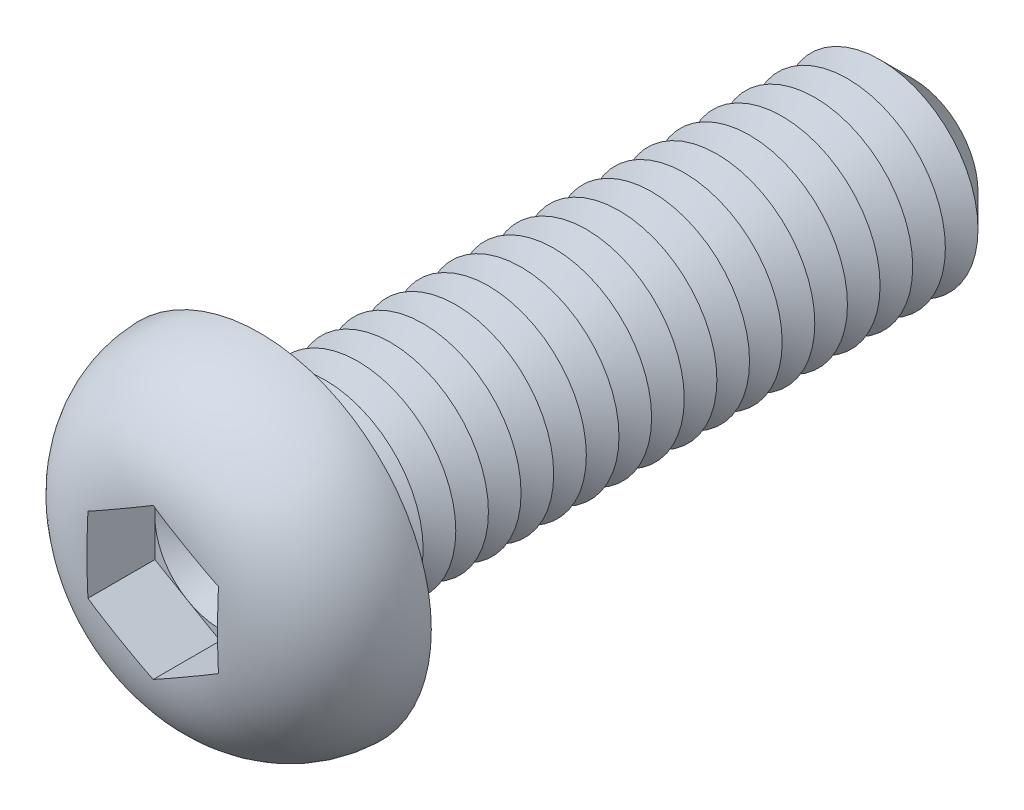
ISO-10303-21;
HEADER;
FILE_DESCRIPTION(('STEP AP214'),'2;1');
FILE_NAME('part.step','',(''),(''),'','','');
FILE_SCHEMA(('AUTOMOTIVE_DESIGN { 1 0 10303 214 1 1 1 1 }'));
ENDSEC;
DATA;
#1=APPLICATION_CONTEXT('core data for automotive mechanical design processes');
#2=APPLICATION_PROTOCOL_DEFINITION('international standard','automotive_design',2000,#1);
#3=PRODUCT_CONTEXT('',#1,'mechanical');
#4=PRODUCT('Part','Part','',(#3));
#5=PRODUCT_RELATED_PRODUCT_CATEGORY('part','',(#4));
#6=PRODUCT_DEFINITION_FORMATION('','',#4);
#7=PRODUCT_DEFINITION_CONTEXT('part definition',#1,'design');
#8=PRODUCT_DEFINITION('design','',#6,#7);
#9=PRODUCT_DEFINITION_SHAPE('','',#8);
#10=(LENGTH_UNIT() NAMED_UNIT(*) SI_UNIT(.MILLI.,.METRE.));
#11=(NAMED_UNIT(*) PLANE_ANGLE_UNIT() SI_UNIT($,.RADIAN.));
#12=(NAMED_UNIT(*) SI_UNIT($,.STERADIAN.) SOLID_ANGLE_UNIT());
#13=UNCERTAINTY_MEASURE_WITH_UNIT(LENGTH_MEASURE(1.E-05),#10,'distance_accuracy_value','');
#14=(GEOMETRIC_REPRESENTATION_CONTEXT(3) GLOBAL_UNCERTAINTY_ASSIGNED_CONTEXT((#13)) GLOBAL_UNIT_ASSIGNED_CONTEXT((#10,
#11,#12)) REPRESENTATION_CONTEXT('',''));
#15=CARTESIAN_POINT('',(0.,0.,0.));
#16=DIRECTION('',(0.,0.,1.));
#17=DIRECTION('',(1.,0.,0.));
#18=AXIS2_PLACEMENT_3D('',#15,#16,#17);
#19=CARTESIAN_POINT('',(0.,0.,1.22));
#20=DIRECTION('',(0.,0.,1.));
#21=DIRECTION('',(1.,0.,0.));
#22=AXIS2_PLACEMENT_3D('',#19,#20,#21);
#23=PLANE('',#22);
#24=CARTESIAN_POINT('',(0.,0.,1.22));
#25=DIRECTION('',(0.,0.,1.));
#26=DIRECTION('',(1.,0.,0.));
#27=AXIS2_PLACEMENT_3D('',#24,#25,#26);
#28=CIRCLE('',#27,2.);
#29=CARTESIAN_POINT('',(2.,0.,1.22));
#30=VERTEX_POINT('',#29);
#31=CARTESIAN_POINT('',(1.,1.73205080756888,1.22));
#32=VERTEX_POINT('',#31);
#33=EDGE_CURVE('E117',#30,#32,#28,.T.);
#34=ORIENTED_EDGE('',*,*,#33,.F.);
#35=DIRECTION('',(0.,1.,0.));
#36=VECTOR('',#35,1.);
#37=CARTESIAN_POINT('',(2.,-1.15470053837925,1.22));
#38=LINE('',#37,#36);
#39=CARTESIAN_POINT('',(2.,1.15470053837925,1.22));
#40=VERTEX_POINT('',#39);
#41=EDGE_CURVE('E140',#30,#40,#38,.T.);
#42=ORIENTED_EDGE('',*,*,#41,.T.);
#43=DIRECTION('',(-0.866025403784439,0.5,0.));
#44=VECTOR('',#43,1.);
#45=CARTESIAN_POINT('',(2.,1.15470053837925,1.22));
#46=LINE('',#45,#44);
#47=EDGE_CURVE('E136',#40,#32,#46,.T.);
#48=ORIENTED_EDGE('',*,*,#47,.T.);
#49=EDGE_LOOP('',(#34,#42,#48));
#50=FACE_BOUND('',#49,.T.);
#51=ADVANCED_FACE('F39',(#50),#23,.T.);
#52=CARTESIAN_POINT('',(0.,0.,1.22));
#53=DIRECTION('',(0.,0.,1.));
#54=DIRECTION('',(1.,0.,0.));
#55=AXIS2_PLACEMENT_3D('',#52,#53,#54);
#56=CIRCLE('',#55,2.);
#57=CARTESIAN_POINT('',(-1.,1.73205080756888,1.22));
#58=VERTEX_POINT('',#57);
#59=EDGE_CURVE('E11',#32,#58,#56,.T.);
#60=ORIENTED_EDGE('',*,*,#59,.F.);
#61=CARTESIAN_POINT('',(0.,2.3094010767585,1.22));
#62=VERTEX_POINT('',#61);
#63=EDGE_CURVE('E130',#32,#62,#46,.T.);
#64=ORIENTED_EDGE('',*,*,#63,.T.);
#65=DIRECTION('',(-0.866025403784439,-0.5,0.));
#66=VECTOR('',#65,1.);
#67=CARTESIAN_POINT('',(0.,2.3094010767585,1.22));
#68=LINE('',#67,#66);
#69=EDGE_CURVE('E131',#62,#58,#68,.T.);
#70=ORIENTED_EDGE('',*,*,#69,.T.);
#71=EDGE_LOOP('',(#60,#64,#70));
#72=FACE_BOUND('',#71,.T.);
#73=ADVANCED_FACE('F129',(#72),#23,.T.);
#74=CARTESIAN_POINT('',(-2.,0.,1.22));
#75=VERTEX_POINT('',#74);
#76=EDGE_CURVE('E49',#58,#75,#56,.T.);
#77=ORIENTED_EDGE('',*,*,#76,.F.);
#78=CARTESIAN_POINT('',(-2.,1.15470053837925,1.22));
#79=VERTEX_POINT('',#78);
#80=EDGE_CURVE('E143',#58,#79,#68,.T.);
#81=ORIENTED_EDGE('',*,*,#80,.T.);
#82=DIRECTION('',(0.,-1.,0.));
#83=VECTOR('',#82,1.);
#84=CARTESIAN_POINT('',(-2.,1.15470053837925,1.22));
#85=LINE('',#84,#83);
#86=EDGE_CURVE('E153',#79,#75,#85,.T.);
#87=ORIENTED_EDGE('',*,*,#86,.T.);
#88=EDGE_LOOP('',(#77,#81,#87));
#89=FACE_BOUND('',#88,.T.);
#90=ADVANCED_FACE('F272',(#89),#23,.T.);
#91=CARTESIAN_POINT('',(-1.,-1.73205080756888,1.22));
#92=VERTEX_POINT('',#91);
#93=EDGE_CURVE('E255',#75,#92,#56,.T.);
#94=ORIENTED_EDGE('',*,*,#93,.F.);
#95=CARTESIAN_POINT('',(-2.,-1.15470053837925,1.22));
#96=VERTEX_POINT('',#95);
#97=EDGE_CURVE('E152',#75,#96,#85,.T.);
#98=ORIENTED_EDGE('',*,*,#97,.T.);
#99=DIRECTION('',(0.866025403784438,-0.5,0.));
#100=VECTOR('',#99,1.);
#101=CARTESIAN_POINT('',(-2.,-1.15470053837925,1.22));
#102=LINE('',#101,#100);
#103=EDGE_CURVE('E158',#96,#92,#102,.T.);
#104=ORIENTED_EDGE('',*,*,#103,.T.);
#105=EDGE_LOOP('',(#94,#98,#104));
#106=FACE_BOUND('',#105,.T.);
#107=ADVANCED_FACE('F266',(#106),#23,.T.);
#108=CARTESIAN_POINT('',(0.999999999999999,-1.73205080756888,1.22));
#109=VERTEX_POINT('',#108);
#110=EDGE_CURVE('E56',#92,#109,#56,.T.);
#111=ORIENTED_EDGE('',*,*,#110,.F.);
#112=CARTESIAN_POINT('',(0.,-2.3094010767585,1.22));
#113=VERTEX_POINT('',#112);
#114=EDGE_CURVE('E157',#92,#113,#102,.T.);
#115=ORIENTED_EDGE('',*,*,#114,.T.);
#116=DIRECTION('',(0.866025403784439,0.5,0.));
#117=VECTOR('',#116,1.);
#118=CARTESIAN_POINT('',(0.,-2.3094010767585,1.22));
#119=LINE('',#118,#117);
#120=EDGE_CURVE('E163',#113,#109,#119,.T.);
#121=ORIENTED_EDGE('',*,*,#120,.T.);
#122=EDGE_LOOP('',(#111,#115,#121));
#123=FACE_BOUND('',#122,.T.);
#124=ADVANCED_FACE('F310',(#123),#23,.T.);
#125=CARTESIAN_POINT('',(0.,0.,-20.));
#126=DIRECTION('',(0.,0.,1.));
#127=DIRECTION('',(1.,0.,0.));
#128=AXIS2_PLACEMENT_3D('',#125,#126,#127);
#129=CYLINDRICAL_SURFACE('',#128,3.);
#130=CARTESIAN_POINT('',(0.,0.,-0.5));
#131=DIRECTION('',(0.,0.,1.));
#132=DIRECTION('',(1.,0.,0.));
#133=AXIS2_PLACEMENT_3D('',#130,#131,#132);
#134=CIRCLE('',#133,3.);
#135=CARTESIAN_POINT('',(3.,0.,-0.5));
#136=VERTEX_POINT('',#135);
#137=EDGE_CURVE('E242',#136,#136,#134,.F.);
#138=ORIENTED_EDGE('',*,*,#137,.T.);
#139=EDGE_LOOP('',(#138));
#140=FACE_BOUND('',#139,.T.);
#141=CARTESIAN_POINT('',(0.,0.,-1.));
#142=DIRECTION('',(0.,0.,1.));
#143=DIRECTION('',(1.,0.,0.));
#144=AXIS2_PLACEMENT_3D('',#141,#142,#143);
#145=CIRCLE('',#144,3.00000000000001);
#146=CARTESIAN_POINT('',(3.00000000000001,0.,-1.));
#147=VERTEX_POINT('',#146);
#148=EDGE_CURVE('E138',#147,#147,#145,.T.);
#149=ORIENTED_EDGE('',*,*,#148,.T.);
#150=EDGE_LOOP('',(#149));
#151=FACE_BOUND('',#150,.T.);
#152=ADVANCED_FACE('F311',(#140,#151),#129,.T.);
#153=CARTESIAN_POINT('',(0.,5.25,0.));
#154=DIRECTION('',(0.,0.,1.));
#155=DIRECTION('',(1.,0.,0.));
#156=AXIS2_PLACEMENT_3D('',#153,#154,#155);
#157=PLANE('',#156);
#158=CARTESIAN_POINT('',(0.,0.,0.));
#159=DIRECTION('',(0.,0.,1.));
#160=DIRECTION('',(1.,0.,0.));
#161=AXIS2_PLACEMENT_3D('',#158,#159,#160);
#162=CIRCLE('',#161,3.5);
#163=CARTESIAN_POINT('',(3.5,0.,0.));
#164=VERTEX_POINT('',#163);
#165=EDGE_CURVE('E245',#164,#164,#162,.T.);
#166=ORIENTED_EDGE('',*,*,#165,.T.);
#167=EDGE_LOOP('',(#166));
#168=FACE_BOUND('',#167,.T.);
#169=CARTESIAN_POINT('',(0.,0.,0.));
#170=DIRECTION('',(0.,0.,1.));
#171=DIRECTION('',(1.,0.,0.));
#172=AXIS2_PLACEMENT_3D('',#169,#170,#171);
#173=CIRCLE('',#172,5.25);
#174=CARTESIAN_POINT('',(5.25,0.,0.));
#175=VERTEX_POINT('',#174);
#176=EDGE_CURVE('E174',#175,#175,#173,.T.);
#177=ORIENTED_EDGE('',*,*,#176,.F.);
#178=EDGE_LOOP('',(#177));
#179=FACE_BOUND('',#178,.T.);
#180=ADVANCED_FACE('F314',(#168,#179),#157,.F.);
#181=CARTESIAN_POINT('',(0.,0.,-0.0999999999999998));
#182=DIRECTION('',(0.,0.,1.));
#183=DIRECTION('',(1.,0.,0.));
#184=AXIS2_PLACEMENT_3D('',#181,#182,#183);
#185=DEGENERATE_TOROIDAL_SURFACE('',#184,1.85147090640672,3.4,.T.);
#186=CARTESIAN_POINT('',(-2.0002,1.15458506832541,3.26900492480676));
#187=CARTESIAN_POINT('',(-1.91694658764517,1.20265144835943,3.27552708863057));
#188=CARTESIAN_POINT('',(-1.83362001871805,1.25076006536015,3.28041849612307));
#189=CARTESIAN_POINT('',(-1.66691146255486,1.34700929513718,3.28784569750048));
#190=CARTESIAN_POINT('',(-1.58352950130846,1.39514989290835,3.29038223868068));
#191=CARTESIAN_POINT('',(-1.4167967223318,1.49141310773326,3.29400753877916));
#192=CARTESIAN_POINT('',(-1.33344591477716,1.5395357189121,3.29509714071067));
#193=CARTESIAN_POINT('',(-1.16673007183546,1.63578915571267,3.29647051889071));
#194=CARTESIAN_POINT('',(-1.08336503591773,1.68391998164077,3.29675420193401));
#195=CARTESIAN_POINT('',(-0.916634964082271,1.78018163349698,3.29675420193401));
#196=CARTESIAN_POINT('',(-0.833269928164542,1.82831245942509,3.29647051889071));
#197=CARTESIAN_POINT('',(-0.666554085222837,1.92456589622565,3.29509714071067));
#198=CARTESIAN_POINT('',(-0.583203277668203,1.9726885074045,3.29400753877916));
#199=CARTESIAN_POINT('',(-0.416470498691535,2.06895172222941,3.29038223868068));
#200=CARTESIAN_POINT('',(-0.333088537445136,2.11709232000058,3.28784569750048));
#201=CARTESIAN_POINT('',(-0.166379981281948,2.21334154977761,3.28041849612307));
#202=CARTESIAN_POINT('',(-0.0830534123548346,2.26145016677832,3.27552708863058));
#203=CARTESIAN_POINT('',(0.000200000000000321,2.30951654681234,3.26900492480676));
#204=B_SPLINE_CURVE_WITH_KNOTS('',3,(#186,#187,#188,#189,#190,#191,#192,#193,#194,#195,#196,
#197,#198,#199,#200,#201,#202,#203),.UNSPECIFIED.,.F.,.F.,(4,2,2,2,2,2,2,2,4),(0.,
0.289010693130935,0.57792963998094,0.866680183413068,1.15546411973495,1.44424805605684,
1.73299859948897,2.02191754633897,2.31092823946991),.UNSPECIFIED.);
#205=CARTESIAN_POINT('',(-2.,1.15470053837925,3.26902062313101));
#206=VERTEX_POINT('',#205);
#207=CARTESIAN_POINT('',(1.70733705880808E-11,2.30940107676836,3.2690206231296));
#208=VERTEX_POINT('',#207);
#209=EDGE_CURVE('E196',#206,#208,#204,.T.);
#210=ORIENTED_EDGE('',*,*,#209,.T.);
#211=CARTESIAN_POINT('',(-0.000199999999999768,2.30951654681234,3.26900492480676));
#212=CARTESIAN_POINT('',(0.0830534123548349,2.26145016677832,3.27552708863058));
#213=CARTESIAN_POINT('',(0.166379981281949,2.21334154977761,3.28041849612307));
#214=CARTESIAN_POINT('',(0.333088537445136,2.11709232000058,3.28784569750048));
#215=CARTESIAN_POINT('',(0.416470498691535,2.06895172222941,3.29038223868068));
#216=CARTESIAN_POINT('',(0.583203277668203,1.9726885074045,3.29400753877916));
#217=CARTESIAN_POINT('',(0.666554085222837,1.92456589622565,3.29509714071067));
#218=CARTESIAN_POINT('',(0.833269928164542,1.82831245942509,3.29647051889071));
#219=CARTESIAN_POINT('',(0.916634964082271,1.78018163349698,3.29675420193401));
#220=CARTESIAN_POINT('',(1.08336503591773,1.68391998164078,3.29675420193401));
#221=CARTESIAN_POINT('',(1.16673007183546,1.63578915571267,3.29647051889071));
#222=CARTESIAN_POINT('',(1.33344591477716,1.5395357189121,3.29509714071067));
#223=CARTESIAN_POINT('',(1.4167967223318,1.49141310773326,3.29400753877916));
#224=CARTESIAN_POINT('',(1.58352950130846,1.39514989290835,3.29038223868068));
#225=CARTESIAN_POINT('',(1.66691146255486,1.34700929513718,3.28784569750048));
#226=CARTESIAN_POINT('',(1.83362001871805,1.25076006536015,3.28041849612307));
#227=CARTESIAN_POINT('',(1.91694658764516,1.20265144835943,3.27552708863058));
#228=CARTESIAN_POINT('',(2.0002,1.15458506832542,3.26900492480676));
#229=B_SPLINE_CURVE_WITH_KNOTS('',3,(#211,#212,#213,#214,#215,#216,#217,#218,#219,#220,#221,
#222,#223,#224,#225,#226,#227,#228),.UNSPECIFIED.,.F.,.F.,(4,2,2,2,2,2,2,2,4),(0.,
0.289010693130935,0.577929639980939,0.866680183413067,1.15546411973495,1.44424805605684,
1.73299859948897,2.02191754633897,2.31092823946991),.UNSPECIFIED.);
#230=CARTESIAN_POINT('',(2.,1.15470053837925,3.26902062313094));
#231=VERTEX_POINT('',#230);
#232=EDGE_CURVE('E225',#208,#231,#229,.T.);
#233=ORIENTED_EDGE('',*,*,#232,.T.);
#234=CARTESIAN_POINT('',(2.,0.,3.29675420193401));
#235=CARTESIAN_POINT('',(2.,-0.0838690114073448,3.29675159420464));
#236=CARTESIAN_POINT('',(2.,-0.167737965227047,3.29653427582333));
#237=CARTESIAN_POINT('',(2.,-0.335473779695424,3.29552217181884));
#238=CARTESIAN_POINT('',(2.,-0.419340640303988,3.29472737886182));
#239=CARTESIAN_POINT('',(2.,-0.587092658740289,3.29218243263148));
#240=CARTESIAN_POINT('',(2.,-0.670977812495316,3.29043194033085));
#241=CARTESIAN_POINT('',(2.,-0.838702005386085,3.28542814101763));
#242=CARTESIAN_POINT('',(2.,-0.922541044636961,3.28217483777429));
#243=CARTESIAN_POINT('',(2.,-1.173343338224,3.26923984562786));
#244=CARTESIAN_POINT('',(2.,-1.34017699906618,3.25638268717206));
#245=CARTESIAN_POINT('',(2.,-1.67225876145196,3.21731215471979));
#246=CARTESIAN_POINT('',(2.,-1.83750825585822,3.19111187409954));
#247=CARTESIAN_POINT('',(2.,-2.10571503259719,3.13417573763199));
#248=CARTESIAN_POINT('',(2.,-2.20973442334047,3.10844622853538));
#249=CARTESIAN_POINT('',(2.,-2.41562153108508,3.04936015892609));
#250=CARTESIAN_POINT('',(2.,-2.51748898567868,3.01600267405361));
#251=CARTESIAN_POINT('',(2.,-2.71832295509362,2.94120377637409));
#252=CARTESIAN_POINT('',(2.,-2.81728700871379,2.89975572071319));
#253=CARTESIAN_POINT('',(2.,-3.01134256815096,2.80859624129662));
#254=CARTESIAN_POINT('',(2.,-3.10643425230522,2.75888519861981));
#255=CARTESIAN_POINT('',(2.,-3.29253530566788,2.65079509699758));
#256=CARTESIAN_POINT('',(2.,-3.38350832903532,2.59235327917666));
#257=CARTESIAN_POINT('',(2.,-3.55964478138,2.46728791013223));
#258=CARTESIAN_POINT('',(2.,-3.64480873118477,2.40066509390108));
#259=CARTESIAN_POINT('',(2.,-3.80840353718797,2.25961603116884));
#260=CARTESIAN_POINT('',(2.,-3.88683504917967,2.18519054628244));
#261=CARTESIAN_POINT('',(2.,-4.03608847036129,2.02906828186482));
#262=CARTESIAN_POINT('',(2.,-4.106911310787,1.94737239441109));
#263=CARTESIAN_POINT('',(2.,-4.23287471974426,1.78665318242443));
#264=CARTESIAN_POINT('',(2.,-4.2888832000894,1.7083085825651));
#265=CARTESIAN_POINT('',(2.,-4.39372062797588,1.54691061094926));
#266=CARTESIAN_POINT('',(2.,-4.44254705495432,1.46385560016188));
#267=CARTESIAN_POINT('',(2.,-4.53249771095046,1.29375158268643));
#268=CARTESIAN_POINT('',(2.,-4.57362814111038,1.20670586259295));
#269=CARTESIAN_POINT('',(2.,-4.6478549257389,1.02924414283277));
#270=CARTESIAN_POINT('',(2.,-4.68094842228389,0.938826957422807));
#271=CARTESIAN_POINT('',(2.,-4.76413649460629,0.674747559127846));
#272=CARTESIAN_POINT('',(2.,-4.80368573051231,0.497625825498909));
#273=CARTESIAN_POINT('',(2.,-4.85179982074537,0.13932226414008));
#274=CARTESIAN_POINT('',(2.,-4.86036774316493,-0.0418591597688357));
#275=CARTESIAN_POINT('',(2.,-4.84642577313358,-0.399473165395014));
#276=CARTESIAN_POINT('',(2.,-4.82452156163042,-0.575929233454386));
#277=CARTESIAN_POINT('',(2.,-4.75142809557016,-0.922615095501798));
#278=CARTESIAN_POINT('',(2.,-4.70024536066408,-1.09284626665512));
#279=CARTESIAN_POINT('',(2.,-4.57020203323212,-1.42258491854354));
#280=CARTESIAN_POINT('',(2.,-4.49131097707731,-1.58208036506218));
#281=CARTESIAN_POINT('',(2.,-4.3083542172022,-1.8860021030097));
#282=CARTESIAN_POINT('',(2.,-4.2042742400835,-2.03041978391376));
#283=CARTESIAN_POINT('',(2.,-3.97174533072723,-2.30354399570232));
#284=CARTESIAN_POINT('',(2.,-3.84281347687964,-2.43183812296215));
#285=CARTESIAN_POINT('',(2.,-3.56631740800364,-2.66612298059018));
#286=CARTESIAN_POINT('',(2.,-3.41877418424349,-2.77213848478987));
#287=CARTESIAN_POINT('',(2.,-3.18261597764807,-2.91604941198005));
#288=CARTESIAN_POINT('',(2.,-3.09905663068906,-2.96247915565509));
#289=CARTESIAN_POINT('',(2.,-2.92856838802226,-3.04879370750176));
#290=CARTESIAN_POINT('',(2.,-2.84163827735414,-3.08867612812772));
#291=CARTESIAN_POINT('',(2.,-2.66495003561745,-3.16199567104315));
#292=CARTESIAN_POINT('',(2.,-2.57518752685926,-3.19542218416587));
#293=CARTESIAN_POINT('',(2.,-2.3936698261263,-3.25594506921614));
#294=CARTESIAN_POINT('',(2.,-2.30191676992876,-3.28304789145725));
#295=CARTESIAN_POINT('',(2.,-2.07265810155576,-3.34285611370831));
#296=CARTESIAN_POINT('',(2.,-1.93423373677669,-3.37205334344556));
#297=CARTESIAN_POINT('',(2.,-1.65546420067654,-3.419280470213));
#298=CARTESIAN_POINT('',(2.,-1.51511762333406,-3.43730169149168));
#299=CARTESIAN_POINT('',(2.,-1.23291689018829,-3.46473877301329));
#300=CARTESIAN_POINT('',(2.,-1.09105869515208,-3.47411015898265));
#301=CARTESIAN_POINT('',(2.,-0.807138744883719,-3.48717303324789));
#302=CARTESIAN_POINT('',(2.,-0.665077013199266,-3.4908651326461));
#303=CARTESIAN_POINT('',(2.,-0.451303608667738,-3.49429675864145));
#304=CARTESIAN_POINT('',(2.,-0.379602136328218,-3.49508825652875));
#305=CARTESIAN_POINT('',(2.,-0.236195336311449,-3.49619580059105));
#306=CARTESIAN_POINT('',(2.,-0.164490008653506,-3.49651184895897));
#307=CARTESIAN_POINT('',(2.,-0.0210718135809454,-3.49680708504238));
#308=CARTESIAN_POINT('',(2.,0.0506410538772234,-3.49678623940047));
#309=CARTESIAN_POINT('',(2.,0.194065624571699,-3.49639104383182));
#310=CARTESIAN_POINT('',(2.,0.265777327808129,-3.49601669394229));
#311=CARTESIAN_POINT('',(2.,0.480501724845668,-3.4941697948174));
#312=CARTESIAN_POINT('',(2.,0.623510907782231,-3.49197539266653));
#313=CARTESIAN_POINT('',(2.,0.909378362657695,-3.48318258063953));
#314=CARTESIAN_POINT('',(2.,1.05223667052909,-3.47658576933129));
#315=CARTESIAN_POINT('',(2.,1.30726724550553,-3.45800282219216));
#316=CARTESIAN_POINT('',(2.,1.41953767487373,-3.44745204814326));
#317=CARTESIAN_POINT('',(2.,1.64336701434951,-3.42020385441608));
#318=CARTESIAN_POINT('',(2.,1.75492585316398,-3.40350582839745));
#319=CARTESIAN_POINT('',(2.,1.97590795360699,-3.36293007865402));
#320=CARTESIAN_POINT('',(2.,2.08534088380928,-3.33910600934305));
#321=CARTESIAN_POINT('',(2.,2.30216001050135,-3.28336687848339));
#322=CARTESIAN_POINT('',(2.,2.40954602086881,-3.25145108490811));
#323=CARTESIAN_POINT('',(2.,2.62289868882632,-3.1784271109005));
#324=CARTESIAN_POINT('',(2.,2.72882262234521,-3.13719314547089));
#325=CARTESIAN_POINT('',(2.,2.93660837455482,-3.04548652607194));
#326=CARTESIAN_POINT('',(2.,3.03847031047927,-2.99501413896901));
#327=CARTESIAN_POINT('',(2.,3.23738754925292,-2.88459171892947));
#328=CARTESIAN_POINT('',(2.,3.33442546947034,-2.82461027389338));
#329=CARTESIAN_POINT('',(2.,3.52225616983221,-2.69545434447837));
#330=CARTESIAN_POINT('',(2.,3.61304636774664,-2.62627609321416));
#331=CARTESIAN_POINT('',(2.,3.77958578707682,-2.48563135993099));
#332=CARTESIAN_POINT('',(2.,3.85595570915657,-2.41489922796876));
#333=CARTESIAN_POINT('',(2.,4.00175744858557,-2.26661746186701));
#334=CARTESIAN_POINT('',(2.,4.07118992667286,-2.18906847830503));
#335=CARTESIAN_POINT('',(2.,4.20228235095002,-2.02784942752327));
#336=CARTESIAN_POINT('',(2.,4.26395450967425,-1.94418931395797));
#337=CARTESIAN_POINT('',(2.,4.37897455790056,-1.7713710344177));
#338=CARTESIAN_POINT('',(2.,4.43232318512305,-1.68221335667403));
#339=CARTESIAN_POINT('',(2.,4.5685109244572,-1.42722170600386));
#340=CARTESIAN_POINT('',(2.,4.64167742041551,-1.25607726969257));
#341=CARTESIAN_POINT('',(2.,4.75695354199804,-0.903699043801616));
#342=CARTESIAN_POINT('',(2.,4.79906366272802,-0.722465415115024));
#343=CARTESIAN_POINT('',(2.,4.84982785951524,-0.362243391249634));
#344=CARTESIAN_POINT('',(2.,4.85966759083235,-0.183422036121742));
#345=CARTESIAN_POINT('',(2.,4.84889099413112,0.17327689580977));
#346=CARTESIAN_POINT('',(2.,4.82827907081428,0.351154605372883));
#347=CARTESIAN_POINT('',(2.,4.75760776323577,0.699332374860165));
#348=CARTESIAN_POINT('',(2.,4.70780624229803,0.869684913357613));
#349=CARTESIAN_POINT('',(2.,4.58058971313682,1.199716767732));
#350=CARTESIAN_POINT('',(2.,4.50317623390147,1.35939667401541));
#351=CARTESIAN_POINT('',(2.,4.32230037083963,1.66542907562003));
#352=CARTESIAN_POINT('',(2.,4.21858077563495,1.81162931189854));
#353=CARTESIAN_POINT('',(2.,3.98879583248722,2.08527000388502));
#354=CARTESIAN_POINT('',(2.,3.86272429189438,2.21270524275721));
#355=CARTESIAN_POINT('',(2.,3.58743550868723,2.45020985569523));
#356=CARTESIAN_POINT('',(2.,3.43756474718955,2.55951924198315));
#357=CARTESIAN_POINT('',(2.,3.12282273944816,2.7535430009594));
#358=CARTESIAN_POINT('',(2.,2.95795742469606,2.83826704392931));
#359=CARTESIAN_POINT('',(2.,2.67096435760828,2.96064273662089));
#360=CARTESIAN_POINT('',(2.,2.55150855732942,3.00473766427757));
#361=CARTESIAN_POINT('',(2.,2.30905936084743,3.08191633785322));
#362=CARTESIAN_POINT('',(2.,2.18606487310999,3.11499664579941));
#363=CARTESIAN_POINT('',(2.,1.93761764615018,3.17114962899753));
#364=CARTESIAN_POINT('',(2.,1.8121607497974,3.19420352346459));
#365=CARTESIAN_POINT('',(2.,1.56000755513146,3.23170431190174));
#366=CARTESIAN_POINT('',(2.,1.43331126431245,3.24615125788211));
#367=CARTESIAN_POINT('',(2.,1.19785080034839,3.26676473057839));
#368=CARTESIAN_POINT('',(2.,1.08915974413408,3.27383022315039));
#369=CARTESIAN_POINT('',(2.,0.87159878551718,3.28448481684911));
#370=CARTESIAN_POINT('',(2.,0.762728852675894,3.28807324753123));
#371=CARTESIAN_POINT('',(2.,0.54488171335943,3.29312180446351));
#372=CARTESIAN_POINT('',(2.,0.435904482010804,3.29458062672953));
#373=CARTESIAN_POINT('',(2.,0.217951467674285,3.29639847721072));
#374=CARTESIAN_POINT('',(2.,0.108975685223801,3.29675759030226));
#375=CARTESIAN_POINT('',(2.,0.,3.29675420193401));
#376=B_SPLINE_CURVE_WITH_KNOTS('',3,(#234,#235,#236,#237,#238,#239,#240,#241,#242,#243,#244,
#245,#246,#247,#248,#249,#250,#251,#252,#253,#254,#255,#256,#257,#258,#259,#260,#261,#262,#263,
#264,#265,#266,#267,#268,#269,#270,#271,#272,#273,#274,#275,#276,#277,#278,#279,#280,#281,#282,
#283,#284,#285,#286,#287,#288,#289,#290,#291,#292,#293,#294,#295,#296,#297,#298,#299,#300,#301,
#302,#303,#304,#305,#306,#307,#308,#309,#310,#311,#312,#313,#314,#315,#316,#317,#318,#319,#320,
#321,#322,#323,#324,#325,#326,#327,#328,#329,#330,#331,#332,#333,#334,#335,#336,#337,#338,#339,
#340,#341,#342,#343,#344,#345,#346,#347,#348,#349,#350,#351,#352,#353,#354,#355,#356,#357,#358,
#359,#360,#361,#362,#363,#364,#365,#366,#367,#368,#369,#370,#371,#372,#373,#374,#375),
.UNSPECIFIED.,.T.,.F.,(4,2,2,2,2,2,2,2,2,2,2,2,2,2,2,2,2,2,2,2,2,2,2,2,2,2,2,2,2,2,2,2,2,2,2,2,
2,2,2,2,2,2,2,2,2,2,2,2,2,2,2,2,2,2,2,2,2,2,2,2,2,2,2,2,2,2,2,2,2,2,4),(0.,0.251606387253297,
0.503215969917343,0.754914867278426,1.00661313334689,1.50825543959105,2.00940643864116,
2.33061510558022,2.65186271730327,2.97337521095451,3.29487288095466,3.61880390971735,
3.94270585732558,4.26657621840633,4.59040689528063,4.8789527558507,5.16759964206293,
5.45601293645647,5.74452864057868,6.28608750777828,6.82759274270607,7.35848716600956,
7.8892634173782,8.42062506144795,8.95228851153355,9.49557283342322,10.0382497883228,
10.3247866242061,10.6114277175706,10.8985359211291,11.1853499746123,11.6091713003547,
12.0333212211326,12.4596400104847,12.8859129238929,13.1010304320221,13.316146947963,
13.5312847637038,13.746422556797,14.1754765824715,14.6043748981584,14.9425387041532,
15.2807358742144,15.6164481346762,15.9521907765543,16.2927694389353,16.6333382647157,
16.9750565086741,17.3169151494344,17.6287548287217,17.9405647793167,18.2518777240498,
18.5631630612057,19.1185081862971,19.6738444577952,20.20853386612,20.7431459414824,
21.2731049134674,21.8030345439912,22.3383600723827,22.8738341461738,23.4279697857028,
23.9818871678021,24.3633752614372,24.7449823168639,25.1273011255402,25.5096176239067,
25.8363061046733,26.163057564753,26.4900090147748,26.8169352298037),.UNSPECIFIED.);
#377=CARTESIAN_POINT('',(2.,-1.15470053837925,3.26902062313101));
#378=VERTEX_POINT('',#377);
#379=EDGE_CURVE('E234',#231,#378,#376,.T.);
#380=ORIENTED_EDGE('',*,*,#379,.T.);
#381=CARTESIAN_POINT('',(2.0002,-1.15458506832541,3.26900492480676));
#382=CARTESIAN_POINT('',(1.91694658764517,-1.20265144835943,3.27552708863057));
#383=CARTESIAN_POINT('',(1.83362001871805,-1.25076006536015,3.28041849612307));
#384=CARTESIAN_POINT('',(1.66691146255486,-1.34700929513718,3.28784569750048));
#385=CARTESIAN_POINT('',(1.58352950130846,-1.39514989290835,3.29038223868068));
#386=CARTESIAN_POINT('',(1.4167967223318,-1.49141310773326,3.29400753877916));
#387=CARTESIAN_POINT('',(1.33344591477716,-1.5395357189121,3.29509714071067));
#388=CARTESIAN_POINT('',(1.16673007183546,-1.63578915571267,3.29647051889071));
#389=CARTESIAN_POINT('',(1.08336503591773,-1.68391998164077,3.29675420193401));
#390=CARTESIAN_POINT('',(0.916634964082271,-1.78018163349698,3.29675420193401));
#391=CARTESIAN_POINT('',(0.833269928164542,-1.82831245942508,3.29647051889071));
#392=CARTESIAN_POINT('',(0.666554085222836,-1.92456589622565,3.29509714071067));
#393=CARTESIAN_POINT('',(0.583203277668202,-1.97268850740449,3.29400753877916));
#394=CARTESIAN_POINT('',(0.416470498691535,-2.06895172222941,3.29038223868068));
#395=CARTESIAN_POINT('',(0.333088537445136,-2.11709232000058,3.28784569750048));
#396=CARTESIAN_POINT('',(0.166379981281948,-2.2133415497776,3.28041849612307));
#397=CARTESIAN_POINT('',(0.0830534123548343,-2.26145016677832,3.27552708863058));
#398=CARTESIAN_POINT('',(-0.000200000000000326,-2.30951654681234,3.26900492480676));
#399=B_SPLINE_CURVE_WITH_KNOTS('',3,(#381,#382,#383,#384,#385,#386,#387,#388,#389,#390,#391,
#392,#393,#394,#395,#396,#397,#398),.UNSPECIFIED.,.F.,.F.,(4,2,2,2,2,2,2,2,4),(0.,
0.289010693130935,0.57792963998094,0.866680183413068,1.15546411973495,1.44424805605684,
1.73299859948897,2.02191754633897,2.31092823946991),.UNSPECIFIED.);
#400=CARTESIAN_POINT('',(0.,-2.3094010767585,3.26902062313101));
#401=VERTEX_POINT('',#400);
#402=EDGE_CURVE('E284',#378,#401,#399,.T.);
#403=ORIENTED_EDGE('',*,*,#402,.T.);
#404=CARTESIAN_POINT('',(0.000199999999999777,-2.30951654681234,3.26900492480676));
#405=CARTESIAN_POINT('',(-0.083053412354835,-2.26145016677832,3.27552708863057));
#406=CARTESIAN_POINT('',(-0.166379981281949,-2.21334154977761,3.28041849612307));
#407=CARTESIAN_POINT('',(-0.333088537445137,-2.11709232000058,3.28784569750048));
#408=CARTESIAN_POINT('',(-0.416470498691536,-2.06895172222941,3.29038223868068));
#409=CARTESIAN_POINT('',(-0.583203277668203,-1.97268850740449,3.29400753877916));
#410=CARTESIAN_POINT('',(-0.666554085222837,-1.92456589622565,3.29509714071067));
#411=CARTESIAN_POINT('',(-0.833269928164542,-1.82831245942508,3.29647051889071));
#412=CARTESIAN_POINT('',(-0.916634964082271,-1.78018163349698,3.29675420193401));
#413=CARTESIAN_POINT('',(-1.08336503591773,-1.68391998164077,3.29675420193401));
#414=CARTESIAN_POINT('',(-1.16673007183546,-1.63578915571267,3.29647051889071));
#415=CARTESIAN_POINT('',(-1.33344591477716,-1.5395357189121,3.29509714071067));
#416=CARTESIAN_POINT('',(-1.4167967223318,-1.49141310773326,3.29400753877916));
#417=CARTESIAN_POINT('',(-1.58352950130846,-1.39514989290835,3.29038223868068));
#418=CARTESIAN_POINT('',(-1.66691146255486,-1.34700929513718,3.28784569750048));
#419=CARTESIAN_POINT('',(-1.83362001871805,-1.25076006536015,3.28041849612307));
#420=CARTESIAN_POINT('',(-1.91694658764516,-1.20265144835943,3.27552708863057));
#421=CARTESIAN_POINT('',(-2.0002,-1.15458506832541,3.26900492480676));
#422=B_SPLINE_CURVE_WITH_KNOTS('',3,(#404,#405,#406,#407,#408,#409,#410,#411,#412,#413,#414,
#415,#416,#417,#418,#419,#420,#421),.UNSPECIFIED.,.F.,.F.,(4,2,2,2,2,2,2,2,4),(0.,
0.289010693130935,0.577929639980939,0.866680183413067,1.15546411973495,1.44424805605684,
1.73299859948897,2.02191754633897,2.31092823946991),.UNSPECIFIED.);
#423=CARTESIAN_POINT('',(-2.,-1.15470053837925,3.26902062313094));
#424=VERTEX_POINT('',#423);
#425=EDGE_CURVE('E279',#401,#424,#422,.T.);
#426=ORIENTED_EDGE('',*,*,#425,.T.);
#427=CARTESIAN_POINT('',(-2.,0.,3.29675420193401));
#428=CARTESIAN_POINT('',(-2.,0.0838690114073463,3.29675159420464));
#429=CARTESIAN_POINT('',(-2.,0.167737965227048,3.29653427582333));
#430=CARTESIAN_POINT('',(-2.,0.335473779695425,3.29552217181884));
#431=CARTESIAN_POINT('',(-2.,0.41934064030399,3.29472737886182));
#432=CARTESIAN_POINT('',(-2.,0.58709265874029,3.29218243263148));
#433=CARTESIAN_POINT('',(-2.,0.670977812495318,3.29043194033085));
#434=CARTESIAN_POINT('',(-2.,0.838702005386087,3.28542814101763));
#435=CARTESIAN_POINT('',(-2.,0.922541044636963,3.28217483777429));
#436=CARTESIAN_POINT('',(-2.,1.173343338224,3.26923984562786));
#437=CARTESIAN_POINT('',(-2.,1.34017699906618,3.25638268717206));
#438=CARTESIAN_POINT('',(-2.,1.67225876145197,3.21731215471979));
#439=CARTESIAN_POINT('',(-2.,1.83750825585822,3.19111187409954));
#440=CARTESIAN_POINT('',(-2.,2.10571503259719,3.13417573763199));
#441=CARTESIAN_POINT('',(-2.,2.20973442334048,3.10844622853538));
#442=CARTESIAN_POINT('',(-2.,2.41562153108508,3.04936015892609));
#443=CARTESIAN_POINT('',(-2.,2.51748898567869,3.01600267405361));
#444=CARTESIAN_POINT('',(-2.,2.71832295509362,2.94120377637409));
#445=CARTESIAN_POINT('',(-2.,2.81728700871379,2.89975572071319));
#446=CARTESIAN_POINT('',(-2.,3.01134256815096,2.80859624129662));
#447=CARTESIAN_POINT('',(-2.,3.10643425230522,2.75888519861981));
#448=CARTESIAN_POINT('',(-2.,3.29253530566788,2.65079509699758));
#449=CARTESIAN_POINT('',(-2.,3.38350832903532,2.59235327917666));
#450=CARTESIAN_POINT('',(-2.,3.55964478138,2.46728791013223));
#451=CARTESIAN_POINT('',(-2.,3.64480873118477,2.40066509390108));
#452=CARTESIAN_POINT('',(-2.,3.80840353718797,2.25961603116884));
#453=CARTESIAN_POINT('',(-2.,3.88683504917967,2.18519054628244));
#454=CARTESIAN_POINT('',(-2.,4.03608847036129,2.02906828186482));
#455=CARTESIAN_POINT('',(-2.,4.106911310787,1.94737239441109));
#456=CARTESIAN_POINT('',(-2.,4.23287471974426,1.78665318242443));
#457=CARTESIAN_POINT('',(-2.,4.2888832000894,1.7083085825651));
#458=CARTESIAN_POINT('',(-2.,4.39372062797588,1.54691061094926));
#459=CARTESIAN_POINT('',(-2.,4.44254705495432,1.46385560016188));
#460=CARTESIAN_POINT('',(-2.,4.53249771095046,1.29375158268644));
#461=CARTESIAN_POINT('',(-2.,4.57362814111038,1.20670586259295));
#462=CARTESIAN_POINT('',(-2.,4.6478549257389,1.02924414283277));
#463=CARTESIAN_POINT('',(-2.,4.68094842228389,0.938826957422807));
#464=CARTESIAN_POINT('',(-2.,4.76413649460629,0.674747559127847));
#465=CARTESIAN_POINT('',(-2.,4.80368573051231,0.497625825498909));
#466=CARTESIAN_POINT('',(-2.,4.85179982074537,0.13932226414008));
#467=CARTESIAN_POINT('',(-2.,4.86036774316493,-0.0418591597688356));
#468=CARTESIAN_POINT('',(-2.,4.84642577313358,-0.399473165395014));
#469=CARTESIAN_POINT('',(-2.,4.82452156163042,-0.575929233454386));
#470=CARTESIAN_POINT('',(-2.,4.75142809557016,-0.922615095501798));
#471=CARTESIAN_POINT('',(-2.,4.70024536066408,-1.09284626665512));
#472=CARTESIAN_POINT('',(-2.,4.57020203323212,-1.42258491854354));
#473=CARTESIAN_POINT('',(-2.,4.49131097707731,-1.58208036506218));
#474=CARTESIAN_POINT('',(-2.,4.3083542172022,-1.8860021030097));
#475=CARTESIAN_POINT('',(-2.,4.2042742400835,-2.03041978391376));
#476=CARTESIAN_POINT('',(-2.,3.97174533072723,-2.30354399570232));
#477=CARTESIAN_POINT('',(-2.,3.84281347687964,-2.43183812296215));
#478=CARTESIAN_POINT('',(-2.,3.56631740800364,-2.66612298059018));
#479=CARTESIAN_POINT('',(-2.,3.41877418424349,-2.77213848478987));
#480=CARTESIAN_POINT('',(-2.,3.18261597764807,-2.91604941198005));
#481=CARTESIAN_POINT('',(-2.,3.09905663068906,-2.96247915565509));
#482=CARTESIAN_POINT('',(-2.,2.92856838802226,-3.04879370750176));
#483=CARTESIAN_POINT('',(-2.,2.84163827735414,-3.08867612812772));
#484=CARTESIAN_POINT('',(-2.,2.66495003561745,-3.16199567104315));
#485=CARTESIAN_POINT('',(-2.,2.57518752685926,-3.19542218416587));
#486=CARTESIAN_POINT('',(-2.,2.3936698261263,-3.25594506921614));
#487=CARTESIAN_POINT('',(-2.,2.30191676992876,-3.28304789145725));
#488=CARTESIAN_POINT('',(-2.,2.07265810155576,-3.34285611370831));
#489=CARTESIAN_POINT('',(-2.,1.93423373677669,-3.37205334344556));
#490=CARTESIAN_POINT('',(-2.,1.65546420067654,-3.419280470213));
#491=CARTESIAN_POINT('',(-2.,1.51511762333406,-3.43730169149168));
#492=CARTESIAN_POINT('',(-2.,1.23291689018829,-3.46473877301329));
#493=CARTESIAN_POINT('',(-2.,1.09105869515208,-3.47411015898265));
#494=CARTESIAN_POINT('',(-2.,0.807138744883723,-3.48717303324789));
#495=CARTESIAN_POINT('',(-2.,0.66507701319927,-3.4908651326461));
#496=CARTESIAN_POINT('',(-2.,0.451303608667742,-3.49429675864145));
#497=CARTESIAN_POINT('',(-2.,0.379602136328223,-3.49508825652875));
#498=CARTESIAN_POINT('',(-2.,0.236195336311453,-3.49619580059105));
#499=CARTESIAN_POINT('',(-2.,0.16449000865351,-3.49651184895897));
#500=CARTESIAN_POINT('',(-2.,0.0210718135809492,-3.49680708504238));
#501=CARTESIAN_POINT('',(-2.,-0.0506410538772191,-3.49678623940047));
#502=CARTESIAN_POINT('',(-2.,-0.194065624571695,-3.49639104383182));
#503=CARTESIAN_POINT('',(-2.,-0.265777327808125,-3.49601669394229));
#504=CARTESIAN_POINT('',(-2.,-0.480501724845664,-3.4941697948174));
#505=CARTESIAN_POINT('',(-2.,-0.623510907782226,-3.49197539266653));
#506=CARTESIAN_POINT('',(-2.,-0.909378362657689,-3.48318258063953));
#507=CARTESIAN_POINT('',(-2.,-1.05223667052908,-3.47658576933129));
#508=CARTESIAN_POINT('',(-2.,-1.30726724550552,-3.45800282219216));
#509=CARTESIAN_POINT('',(-2.,-1.41953767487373,-3.44745204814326));
#510=CARTESIAN_POINT('',(-2.,-1.6433670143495,-3.42020385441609));
#511=CARTESIAN_POINT('',(-2.,-1.75492585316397,-3.40350582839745));
#512=CARTESIAN_POINT('',(-2.,-1.97590795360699,-3.36293007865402));
#513=CARTESIAN_POINT('',(-2.,-2.08534088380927,-3.33910600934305));
#514=CARTESIAN_POINT('',(-2.,-2.30216001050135,-3.28336687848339));
#515=CARTESIAN_POINT('',(-2.,-2.4095460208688,-3.25145108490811));
#516=CARTESIAN_POINT('',(-2.,-2.62289868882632,-3.1784271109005));
#517=CARTESIAN_POINT('',(-2.,-2.72882262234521,-3.13719314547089));
#518=CARTESIAN_POINT('',(-2.,-2.93660837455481,-3.04548652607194));
#519=CARTESIAN_POINT('',(-2.,-3.03847031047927,-2.99501413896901));
#520=CARTESIAN_POINT('',(-2.,-3.23738754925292,-2.88459171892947));
#521=CARTESIAN_POINT('',(-2.,-3.33442546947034,-2.82461027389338));
#522=CARTESIAN_POINT('',(-2.,-3.52225616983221,-2.69545434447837));
#523=CARTESIAN_POINT('',(-2.,-3.61304636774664,-2.62627609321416));
#524=CARTESIAN_POINT('',(-2.,-3.77958578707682,-2.48563135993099));
#525=CARTESIAN_POINT('',(-2.,-3.85595570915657,-2.41489922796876));
#526=CARTESIAN_POINT('',(-2.,-4.00175744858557,-2.26661746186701));
#527=CARTESIAN_POINT('',(-2.,-4.07118992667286,-2.18906847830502));
#528=CARTESIAN_POINT('',(-2.,-4.20228235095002,-2.02784942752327));
#529=CARTESIAN_POINT('',(-2.,-4.26395450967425,-1.94418931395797));
#530=CARTESIAN_POINT('',(-2.,-4.37897455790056,-1.7713710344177));
#531=CARTESIAN_POINT('',(-2.,-4.43232318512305,-1.68221335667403));
#532=CARTESIAN_POINT('',(-2.,-4.5685109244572,-1.42722170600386));
#533=CARTESIAN_POINT('',(-2.,-4.64167742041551,-1.25607726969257));
#534=CARTESIAN_POINT('',(-2.,-4.75695354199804,-0.903699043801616));
#535=CARTESIAN_POINT('',(-2.,-4.79906366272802,-0.722465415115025));
#536=CARTESIAN_POINT('',(-2.,-4.84982785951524,-0.362243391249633));
#537=CARTESIAN_POINT('',(-2.,-4.85966759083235,-0.18342203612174));
#538=CARTESIAN_POINT('',(-2.,-4.84889099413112,0.173276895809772));
#539=CARTESIAN_POINT('',(-2.,-4.82827907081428,0.351154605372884));
#540=CARTESIAN_POINT('',(-2.,-4.75760776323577,0.699332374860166));
#541=CARTESIAN_POINT('',(-2.,-4.70780624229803,0.869684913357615));
#542=CARTESIAN_POINT('',(-2.,-4.58058971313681,1.199716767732));
#543=CARTESIAN_POINT('',(-2.,-4.50317623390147,1.35939667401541));
#544=CARTESIAN_POINT('',(-2.,-4.32230037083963,1.66542907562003));
#545=CARTESIAN_POINT('',(-2.,-4.21858077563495,1.81162931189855));
#546=CARTESIAN_POINT('',(-2.,-3.98879583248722,2.08527000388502));
#547=CARTESIAN_POINT('',(-2.,-3.86272429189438,2.21270524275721));
#548=CARTESIAN_POINT('',(-2.,-3.58743550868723,2.45020985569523));
#549=CARTESIAN_POINT('',(-2.,-3.43756474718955,2.55951924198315));
#550=CARTESIAN_POINT('',(-2.,-3.12282273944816,2.7535430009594));
#551=CARTESIAN_POINT('',(-2.,-2.95795742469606,2.8382670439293));
#552=CARTESIAN_POINT('',(-2.,-2.67096435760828,2.96064273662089));
#553=CARTESIAN_POINT('',(-2.,-2.55150855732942,3.00473766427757));
#554=CARTESIAN_POINT('',(-2.,-2.30905936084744,3.08191633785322));
#555=CARTESIAN_POINT('',(-2.,-2.18606487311,3.11499664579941));
#556=CARTESIAN_POINT('',(-2.,-1.93761764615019,3.17114962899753));
#557=CARTESIAN_POINT('',(-2.,-1.81216074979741,3.19420352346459));
#558=CARTESIAN_POINT('',(-2.,-1.56000755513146,3.23170431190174));
#559=CARTESIAN_POINT('',(-2.,-1.43331126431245,3.24615125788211));
#560=CARTESIAN_POINT('',(-2.,-1.19785080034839,3.26676473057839));
#561=CARTESIAN_POINT('',(-2.,-1.08915974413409,3.27383022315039));
#562=CARTESIAN_POINT('',(-2.,-0.871598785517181,3.28448481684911));
#563=CARTESIAN_POINT('',(-2.,-0.762728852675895,3.28807324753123));
#564=CARTESIAN_POINT('',(-2.,-0.54488171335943,3.29312180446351));
#565=CARTESIAN_POINT('',(-2.,-0.435904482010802,3.29458062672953));
#566=CARTESIAN_POINT('',(-2.,-0.217951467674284,3.29639847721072));
#567=CARTESIAN_POINT('',(-2.,-0.108975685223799,3.29675759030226));
#568=CARTESIAN_POINT('',(-2.,0.,3.29675420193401));
#569=B_SPLINE_CURVE_WITH_KNOTS('',3,(#427,#428,#429,#430,#431,#432,#433,#434,#435,#436,#437,
#438,#439,#440,#441,#442,#443,#444,#445,#446,#447,#448,#449,#450,#451,#452,#453,#454,#455,#456,
#457,#458,#459,#460,#461,#462,#463,#464,#465,#466,#467,#468,#469,#470,#471,#472,#473,#474,#475,
#476,#477,#478,#479,#480,#481,#482,#483,#484,#485,#486,#487,#488,#489,#490,#491,#492,#493,#494,
#495,#496,#497,#498,#499,#500,#501,#502,#503,#504,#505,#506,#507,#508,#509,#510,#511,#512,#513,
#514,#515,#516,#517,#518,#519,#520,#521,#522,#523,#524,#525,#526,#527,#528,#529,#530,#531,#532,
#533,#534,#535,#536,#537,#538,#539,#540,#541,#542,#543,#544,#545,#546,#547,#548,#549,#550,#551,
#552,#553,#554,#555,#556,#557,#558,#559,#560,#561,#562,#563,#564,#565,#566,#567,#568),
.UNSPECIFIED.,.T.,.F.,(4,2,2,2,2,2,2,2,2,2,2,2,2,2,2,2,2,2,2,2,2,2,2,2,2,2,2,2,2,2,2,2,2,2,2,2,
2,2,2,2,2,2,2,2,2,2,2,2,2,2,2,2,2,2,2,2,2,2,2,2,2,2,2,2,2,2,2,2,2,2,4),(0.,0.251606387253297,
0.503215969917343,0.754914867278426,1.0066131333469,1.50825543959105,2.00940643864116,
2.33061510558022,2.65186271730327,2.97337521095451,3.29487288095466,3.61880390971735,
3.94270585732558,4.26657621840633,4.59040689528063,4.8789527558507,5.16759964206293,
5.45601293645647,5.74452864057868,6.28608750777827,6.82759274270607,7.35848716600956,
7.88926341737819,8.42062506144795,8.95228851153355,9.49557283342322,10.0382497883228,
10.3247866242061,10.6114277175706,10.8985359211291,11.1853499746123,11.6091713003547,
12.0333212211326,12.4596400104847,12.8859129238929,13.1010304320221,13.316146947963,
13.5312847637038,13.746422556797,14.1754765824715,14.6043748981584,14.9425387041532,
15.2807358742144,15.6164481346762,15.9521907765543,16.2927694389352,16.6333382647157,
16.9750565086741,17.3169151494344,17.6287548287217,17.9405647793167,18.2518777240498,
18.5631630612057,19.1185081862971,19.6738444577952,20.20853386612,20.7431459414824,
21.2731049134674,21.8030345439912,22.3383600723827,22.8738341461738,23.4279697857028,
23.981887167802,24.3633752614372,24.7449823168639,25.1273011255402,25.5096176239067,
25.8363061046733,26.163057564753,26.4900090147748,26.8169352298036),.UNSPECIFIED.);
#570=EDGE_CURVE('E205',#424,#206,#569,.T.);
#571=ORIENTED_EDGE('',*,*,#570,.T.);
#572=EDGE_LOOP('',(#210,#233,#380,#403,#426,#571));
#573=FACE_BOUND('',#572,.T.);
#574=ORIENTED_EDGE('',*,*,#176,.T.);
#575=EDGE_LOOP('',(#574));
#576=FACE_BOUND('',#575,.T.);
#577=ADVANCED_FACE('F210',(#573,#576),#185,.T.);
#578=CARTESIAN_POINT('',(2.,1.15470053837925,1.22));
#579=DIRECTION('',(0.5,0.866025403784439,0.));
#580=DIRECTION('',(-0.866025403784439,0.5,0.));
#581=AXIS2_PLACEMENT_3D('',#578,#579,#580);
#582=PLANE('',#581);
#583=DIRECTION('',(0.,0.,1.));
#584=VECTOR('',#583,1.);
#585=CARTESIAN_POINT('',(0.,2.3094010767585,1.22));
#586=LINE('',#585,#584);
#587=EDGE_CURVE('E64',#62,#208,#586,.T.);
#588=ORIENTED_EDGE('',*,*,#587,.F.);
#589=ORIENTED_EDGE('',*,*,#63,.F.);
#590=ORIENTED_EDGE('',*,*,#47,.F.);
#591=DIRECTION('',(0.,0.,1.));
#592=VECTOR('',#591,1.);
#593=CARTESIAN_POINT('',(2.,1.15470053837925,1.22));
#594=LINE('',#593,#592);
#595=EDGE_CURVE('E171',#40,#231,#594,.T.);
#596=ORIENTED_EDGE('',*,*,#595,.T.);
#597=ORIENTED_EDGE('',*,*,#232,.F.);
#598=EDGE_LOOP('',(#588,#589,#590,#596,#597));
#599=FACE_BOUND('',#598,.T.);
#600=ADVANCED_FACE('F134',(#599),#582,.F.);
#601=CARTESIAN_POINT('',(2.,-1.15470053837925,1.22));
#602=DIRECTION('',(1.,0.,0.));
#603=DIRECTION('',(0.,1.,0.));
#604=AXIS2_PLACEMENT_3D('',#601,#602,#603);
#605=PLANE('',#604);
#606=ORIENTED_EDGE('',*,*,#595,.F.);
#607=ORIENTED_EDGE('',*,*,#41,.F.);
#608=CARTESIAN_POINT('',(2.,-1.15470053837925,1.22));
#609=VERTEX_POINT('',#608);
#610=EDGE_CURVE('E167',#609,#30,#38,.T.);
#611=ORIENTED_EDGE('',*,*,#610,.F.);
#612=DIRECTION('',(0.,0.,1.));
#613=VECTOR('',#612,1.);
#614=CARTESIAN_POINT('',(2.,-1.15470053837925,1.22));
#615=LINE('',#614,#613);
#616=EDGE_CURVE('E175',#609,#378,#615,.T.);
#617=ORIENTED_EDGE('',*,*,#616,.T.);
#618=ORIENTED_EDGE('',*,*,#379,.F.);
#619=EDGE_LOOP('',(#606,#607,#611,#617,#618));
#620=FACE_BOUND('',#619,.T.);
#621=ADVANCED_FACE('F223',(#620),#605,.F.);
#622=CARTESIAN_POINT('',(0.,-2.3094010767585,1.22));
#623=DIRECTION('',(0.5,-0.866025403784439,0.));
#624=DIRECTION('',(0.866025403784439,0.5,0.));
#625=AXIS2_PLACEMENT_3D('',#622,#623,#624);
#626=PLANE('',#625);
#627=ORIENTED_EDGE('',*,*,#616,.F.);
#628=EDGE_CURVE('E162',#109,#609,#119,.T.);
#629=ORIENTED_EDGE('',*,*,#628,.F.);
#630=ORIENTED_EDGE('',*,*,#120,.F.);
#631=DIRECTION('',(0.,0.,1.));
#632=VECTOR('',#631,1.);
#633=CARTESIAN_POINT('',(0.,-2.3094010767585,1.22));
#634=LINE('',#633,#632);
#635=EDGE_CURVE('E179',#113,#401,#634,.T.);
#636=ORIENTED_EDGE('',*,*,#635,.T.);
#637=ORIENTED_EDGE('',*,*,#402,.F.);
#638=EDGE_LOOP('',(#627,#629,#630,#636,#637));
#639=FACE_BOUND('',#638,.T.);
#640=ADVANCED_FACE('F297',(#639),#626,.F.);
#641=CARTESIAN_POINT('',(-2.,-1.15470053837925,1.22));
#642=DIRECTION('',(-0.5,-0.866025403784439,0.));
#643=DIRECTION('',(0.866025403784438,-0.5,0.));
#644=AXIS2_PLACEMENT_3D('',#641,#642,#643);
#645=PLANE('',#644);
#646=ORIENTED_EDGE('',*,*,#635,.F.);
#647=ORIENTED_EDGE('',*,*,#114,.F.);
#648=ORIENTED_EDGE('',*,*,#103,.F.);
#649=DIRECTION('',(0.,0.,1.));
#650=VECTOR('',#649,1.);
#651=CARTESIAN_POINT('',(-2.,-1.15470053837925,1.22));
#652=LINE('',#651,#650);
#653=EDGE_CURVE('E183',#96,#424,#652,.T.);
#654=ORIENTED_EDGE('',*,*,#653,.T.);
#655=ORIENTED_EDGE('',*,*,#425,.F.);
#656=EDGE_LOOP('',(#646,#647,#648,#654,#655));
#657=FACE_BOUND('',#656,.T.);
#658=ADVANCED_FACE('F294',(#657),#645,.F.);
#659=CARTESIAN_POINT('',(-2.,1.15470053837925,1.22));
#660=DIRECTION('',(-1.,0.,0.));
#661=DIRECTION('',(0.,-1.,0.));
#662=AXIS2_PLACEMENT_3D('',#659,#660,#661);
#663=PLANE('',#662);
#664=ORIENTED_EDGE('',*,*,#653,.F.);
#665=ORIENTED_EDGE('',*,*,#97,.F.);
#666=ORIENTED_EDGE('',*,*,#86,.F.);
#667=DIRECTION('',(0.,0.,1.));
#668=VECTOR('',#667,1.);
#669=CARTESIAN_POINT('',(-2.,1.15470053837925,1.22));
#670=LINE('',#669,#668);
#671=EDGE_CURVE('E187',#79,#206,#670,.T.);
#672=ORIENTED_EDGE('',*,*,#671,.T.);
#673=ORIENTED_EDGE('',*,*,#570,.F.);
#674=EDGE_LOOP('',(#664,#665,#666,#672,#673));
#675=FACE_BOUND('',#674,.T.);
#676=ADVANCED_FACE('F218',(#675),#663,.F.);
#677=CARTESIAN_POINT('',(0.,2.3094010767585,1.22));
#678=DIRECTION('',(-0.5,0.866025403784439,0.));
#679=DIRECTION('',(-0.866025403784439,-0.5,0.));
#680=AXIS2_PLACEMENT_3D('',#677,#678,#679);
#681=PLANE('',#680);
#682=ORIENTED_EDGE('',*,*,#671,.F.);
#683=ORIENTED_EDGE('',*,*,#80,.F.);
#684=ORIENTED_EDGE('',*,*,#69,.F.);
#685=ORIENTED_EDGE('',*,*,#587,.T.);
#686=ORIENTED_EDGE('',*,*,#209,.F.);
#687=EDGE_LOOP('',(#682,#683,#684,#685,#686));
#688=FACE_BOUND('',#687,.T.);
#689=ADVANCED_FACE('F214',(#688),#681,.F.);
#690=EDGE_CURVE('E43',#109,#30,#56,.T.);
#691=ORIENTED_EDGE('',*,*,#690,.F.);
#692=ORIENTED_EDGE('',*,*,#628,.T.);
#693=ORIENTED_EDGE('',*,*,#610,.T.);
#694=EDGE_LOOP('',(#691,#692,#693));
#695=FACE_BOUND('',#694,.T.);
#696=ADVANCED_FACE('F217',(#695),#23,.T.);
#697=CARTESIAN_POINT('',(0.,0.,-1.));
#698=DIRECTION('',(0.,0.,1.));
#699=DIRECTION('',(1.,0.,0.));
#700=AXIS2_PLACEMENT_3D('',#697,#698,#699);
#701=CONICAL_SURFACE('',#700,3.00000000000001,1.0471975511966);
#702=CARTESIAN_POINT('',(0.,0.,-1.5));
#703=DIRECTION('',(0.,0.,1.));
#704=DIRECTION('',(1.,0.,0.));
#705=AXIS2_PLACEMENT_3D('',#702,#703,#704);
#706=CIRCLE('',#705,2.13397459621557);
#707=CARTESIAN_POINT('',(2.13397459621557,0.,-1.5));
#708=VERTEX_POINT('',#707);
#709=EDGE_CURVE('E546',#708,#708,#706,.T.);
#710=ORIENTED_EDGE('',*,*,#709,.T.);
#711=EDGE_LOOP('',(#710));
#712=FACE_BOUND('',#711,.T.);
#713=ORIENTED_EDGE('',*,*,#148,.F.);
#714=EDGE_LOOP('',(#713));
#715=FACE_BOUND('',#714,.T.);
#716=ADVANCED_FACE('F308',(#712,#715),#701,.T.);
#717=CARTESIAN_POINT('',(0.,0.,-1.5));
#718=DIRECTION('',(0.,0.,-1.));
#719=DIRECTION('',(-1.,0.,0.));
#720=AXIS2_PLACEMENT_3D('',#717,#718,#719);
#721=CONICAL_SURFACE('',#720,2.13397459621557,1.0471975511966);
#722=CARTESIAN_POINT('',(0.,0.,-2.));
#723=DIRECTION('',(0.,0.,1.));
#724=DIRECTION('',(1.,0.,0.));
#725=AXIS2_PLACEMENT_3D('',#722,#723,#724);
#726=CIRCLE('',#725,3.00000000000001);
#727=CARTESIAN_POINT('',(3.00000000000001,0.,-2.));
#728=VERTEX_POINT('',#727);
#729=EDGE_CURVE('E544',#728,#728,#726,.T.);
#730=ORIENTED_EDGE('',*,*,#729,.T.);
#731=EDGE_LOOP('',(#730));
#732=FACE_BOUND('',#731,.T.);
#733=ORIENTED_EDGE('',*,*,#709,.F.);
#734=EDGE_LOOP('',(#733));
#735=FACE_BOUND('',#734,.T.);
#736=ADVANCED_FACE('F324',(#732,#735),#721,.T.);
#737=CARTESIAN_POINT('',(0.,0.,-2.));
#738=DIRECTION('',(0.,0.,1.));
#739=DIRECTION('',(1.,0.,0.));
#740=AXIS2_PLACEMENT_3D('',#737,#738,#739);
#741=CONICAL_SURFACE('',#740,3.00000000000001,1.0471975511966);
#742=CARTESIAN_POINT('',(0.,0.,-2.5));
#743=DIRECTION('',(0.,0.,1.));
#744=DIRECTION('',(1.,0.,0.));
#745=AXIS2_PLACEMENT_3D('',#742,#743,#744);
#746=CIRCLE('',#745,2.13397459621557);
#747=CARTESIAN_POINT('',(2.13397459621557,0.,-2.5));
#748=VERTEX_POINT('',#747);
#749=EDGE_CURVE('E540',#748,#748,#746,.T.);
#750=ORIENTED_EDGE('',*,*,#749,.T.);
#751=EDGE_LOOP('',(#750));
#752=FACE_BOUND('',#751,.T.);
#753=ORIENTED_EDGE('',*,*,#729,.F.);
#754=EDGE_LOOP('',(#753));
#755=FACE_BOUND('',#754,.T.);
#756=ADVANCED_FACE('F328',(#752,#755),#741,.T.);
#757=CARTESIAN_POINT('',(0.,0.,-2.5));
#758=DIRECTION('',(0.,0.,-1.));
#759=DIRECTION('',(-1.,0.,0.));
#760=AXIS2_PLACEMENT_3D('',#757,#758,#759);
#761=CONICAL_SURFACE('',#760,2.13397459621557,1.0471975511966);
#762=CARTESIAN_POINT('',(0.,0.,-3.));
#763=DIRECTION('',(0.,0.,1.));
#764=DIRECTION('',(1.,0.,0.));
#765=AXIS2_PLACEMENT_3D('',#762,#763,#764);
#766=CIRCLE('',#765,3.00000000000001);
#767=CARTESIAN_POINT('',(3.00000000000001,0.,-3.));
#768=VERTEX_POINT('',#767);
#769=EDGE_CURVE('E489',#768,#768,#766,.T.);
#770=ORIENTED_EDGE('',*,*,#769,.T.);
#771=EDGE_LOOP('',(#770));
#772=FACE_BOUND('',#771,.T.);
#773=ORIENTED_EDGE('',*,*,#749,.F.);
#774=EDGE_LOOP('',(#773));
#775=FACE_BOUND('',#774,.T.);
#776=ADVANCED_FACE('F332',(#772,#775),#761,.T.);
#777=CARTESIAN_POINT('',(0.,0.,-3.));
#778=DIRECTION('',(0.,0.,1.));
#779=DIRECTION('',(1.,0.,0.));
#780=AXIS2_PLACEMENT_3D('',#777,#778,#779);
#781=CONICAL_SURFACE('',#780,3.00000000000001,1.0471975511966);
#782=CARTESIAN_POINT('',(0.,0.,-3.5));
#783=DIRECTION('',(0.,0.,1.));
#784=DIRECTION('',(1.,0.,0.));
#785=AXIS2_PLACEMENT_3D('',#782,#783,#784);
#786=CIRCLE('',#785,2.13397459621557);
#787=CARTESIAN_POINT('',(2.13397459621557,0.,-3.5));
#788=VERTEX_POINT('',#787);
#789=EDGE_CURVE('E527',#788,#788,#786,.T.);
#790=ORIENTED_EDGE('',*,*,#789,.T.);
#791=EDGE_LOOP('',(#790));
#792=FACE_BOUND('',#791,.T.);
#793=ORIENTED_EDGE('',*,*,#769,.F.);
#794=EDGE_LOOP('',(#793));
#795=FACE_BOUND('',#794,.T.);
#796=ADVANCED_FACE('F336',(#792,#795),#781,.T.);
#797=CARTESIAN_POINT('',(0.,0.,-3.5));
#798=DIRECTION('',(0.,0.,-1.));
#799=DIRECTION('',(-1.,0.,0.));
#800=AXIS2_PLACEMENT_3D('',#797,#798,#799);
#801=CONICAL_SURFACE('',#800,2.13397459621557,1.0471975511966);
#802=CARTESIAN_POINT('',(0.,0.,-4.));
#803=DIRECTION('',(0.,0.,1.));
#804=DIRECTION('',(1.,0.,0.));
#805=AXIS2_PLACEMENT_3D('',#802,#803,#804);
#806=CIRCLE('',#805,3.00000000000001);
#807=CARTESIAN_POINT('',(3.00000000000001,0.,-4.));
#808=VERTEX_POINT('',#807);
#809=EDGE_CURVE('E522',#808,#808,#806,.T.);
#810=ORIENTED_EDGE('',*,*,#809,.T.);
#811=EDGE_LOOP('',(#810));
#812=FACE_BOUND('',#811,.T.);
#813=ORIENTED_EDGE('',*,*,#789,.F.);
#814=EDGE_LOOP('',(#813));
#815=FACE_BOUND('',#814,.T.);
#816=ADVANCED_FACE('F340',(#812,#815),#801,.T.);
#817=CARTESIAN_POINT('',(0.,0.,-4.));
#818=DIRECTION('',(0.,0.,1.));
#819=DIRECTION('',(1.,0.,0.));
#820=AXIS2_PLACEMENT_3D('',#817,#818,#819);
#821=CONICAL_SURFACE('',#820,3.00000000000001,1.0471975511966);
#822=CARTESIAN_POINT('',(0.,0.,-4.5));
#823=DIRECTION('',(0.,0.,1.));
#824=DIRECTION('',(1.,0.,0.));
#825=AXIS2_PLACEMENT_3D('',#822,#823,#824);
#826=CIRCLE('',#825,2.13397459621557);
#827=CARTESIAN_POINT('',(2.13397459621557,0.,-4.5));
#828=VERTEX_POINT('',#827);
#829=EDGE_CURVE('E520',#828,#828,#826,.T.);
#830=ORIENTED_EDGE('',*,*,#829,.T.);
#831=EDGE_LOOP('',(#830));
#832=FACE_BOUND('',#831,.T.);
#833=ORIENTED_EDGE('',*,*,#809,.F.);
#834=EDGE_LOOP('',(#833));
#835=FACE_BOUND('',#834,.T.);
#836=ADVANCED_FACE('F344',(#832,#835),#821,.T.);
#837=CARTESIAN_POINT('',(0.,0.,-4.5));
#838=DIRECTION('',(0.,0.,-1.));
#839=DIRECTION('',(-1.,0.,0.));
#840=AXIS2_PLACEMENT_3D('',#837,#838,#839);
#841=CONICAL_SURFACE('',#840,2.13397459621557,1.0471975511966);
#842=CARTESIAN_POINT('',(0.,0.,-5.));
#843=DIRECTION('',(0.,0.,1.));
#844=DIRECTION('',(1.,0.,0.));
#845=AXIS2_PLACEMENT_3D('',#842,#843,#844);
#846=CIRCLE('',#845,3.00000000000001);
#847=CARTESIAN_POINT('',(3.00000000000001,0.,-5.));
#848=VERTEX_POINT('',#847);
#849=EDGE_CURVE('E523',#848,#848,#846,.T.);
#850=ORIENTED_EDGE('',*,*,#849,.T.);
#851=EDGE_LOOP('',(#850));
#852=FACE_BOUND('',#851,.T.);
#853=ORIENTED_EDGE('',*,*,#829,.F.);
#854=EDGE_LOOP('',(#853));
#855=FACE_BOUND('',#854,.T.);
#856=ADVANCED_FACE('F348',(#852,#855),#841,.T.);
#857=CARTESIAN_POINT('',(0.,0.,-5.));
#858=DIRECTION('',(0.,0.,1.));
#859=DIRECTION('',(1.,0.,0.));
#860=AXIS2_PLACEMENT_3D('',#857,#858,#859);
#861=CONICAL_SURFACE('',#860,3.00000000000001,1.0471975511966);
#862=CARTESIAN_POINT('',(0.,0.,-5.5));
#863=DIRECTION('',(0.,0.,1.));
#864=DIRECTION('',(1.,0.,0.));
#865=AXIS2_PLACEMENT_3D('',#862,#863,#864);
#866=CIRCLE('',#865,2.13397459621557);
#867=CARTESIAN_POINT('',(2.13397459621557,0.,-5.5));
#868=VERTEX_POINT('',#867);
#869=EDGE_CURVE('E531',#868,#868,#866,.T.);
#870=ORIENTED_EDGE('',*,*,#869,.T.);
#871=EDGE_LOOP('',(#870));
#872=FACE_BOUND('',#871,.T.);
#873=ORIENTED_EDGE('',*,*,#849,.F.);
#874=EDGE_LOOP('',(#873));
#875=FACE_BOUND('',#874,.T.);
#876=ADVANCED_FACE('F352',(#872,#875),#861,.T.);
#877=CARTESIAN_POINT('',(0.,0.,-5.5));
#878=DIRECTION('',(0.,0.,-1.));
#879=DIRECTION('',(-1.,0.,0.));
#880=AXIS2_PLACEMENT_3D('',#877,#878,#879);
#881=CONICAL_SURFACE('',#880,2.13397459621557,1.0471975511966);
#882=CARTESIAN_POINT('',(0.,0.,-6.));
#883=DIRECTION('',(0.,0.,1.));
#884=DIRECTION('',(1.,0.,0.));
#885=AXIS2_PLACEMENT_3D('',#882,#883,#884);
#886=CIRCLE('',#885,3.00000000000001);
#887=CARTESIAN_POINT('',(3.00000000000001,0.,-6.));
#888=VERTEX_POINT('',#887);
#889=EDGE_CURVE('E558',#888,#888,#886,.T.);
#890=ORIENTED_EDGE('',*,*,#889,.T.);
#891=EDGE_LOOP('',(#890));
#892=FACE_BOUND('',#891,.T.);
#893=ORIENTED_EDGE('',*,*,#869,.F.);
#894=EDGE_LOOP('',(#893));
#895=FACE_BOUND('',#894,.T.);
#896=ADVANCED_FACE('F356',(#892,#895),#881,.T.);
#897=CARTESIAN_POINT('',(0.,0.,-6.));
#898=DIRECTION('',(0.,0.,1.));
#899=DIRECTION('',(1.,0.,0.));
#900=AXIS2_PLACEMENT_3D('',#897,#898,#899);
#901=CONICAL_SURFACE('',#900,3.00000000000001,1.0471975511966);
#902=CARTESIAN_POINT('',(0.,0.,-6.5));
#903=DIRECTION('',(0.,0.,1.));
#904=DIRECTION('',(1.,0.,0.));
#905=AXIS2_PLACEMENT_3D('',#902,#903,#904);
#906=CIRCLE('',#905,2.13397459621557);
#907=CARTESIAN_POINT('',(2.13397459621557,0.,-6.5));
#908=VERTEX_POINT('',#907);
#909=EDGE_CURVE('E518',#908,#908,#906,.T.);
#910=ORIENTED_EDGE('',*,*,#909,.T.);
#911=EDGE_LOOP('',(#910));
#912=FACE_BOUND('',#911,.T.);
#913=ORIENTED_EDGE('',*,*,#889,.F.);
#914=EDGE_LOOP('',(#913));
#915=FACE_BOUND('',#914,.T.);
#916=ADVANCED_FACE('F360',(#912,#915),#901,.T.);
#917=CARTESIAN_POINT('',(0.,0.,-6.5));
#918=DIRECTION('',(0.,0.,-1.));
#919=DIRECTION('',(-1.,0.,0.));
#920=AXIS2_PLACEMENT_3D('',#917,#918,#919);
#921=CONICAL_SURFACE('',#920,2.13397459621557,1.0471975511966);
#922=CARTESIAN_POINT('',(0.,0.,-7.));
#923=DIRECTION('',(0.,0.,1.));
#924=DIRECTION('',(1.,0.,0.));
#925=AXIS2_PLACEMENT_3D('',#922,#923,#924);
#926=CIRCLE('',#925,3.00000000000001);
#927=CARTESIAN_POINT('',(3.00000000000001,0.,-7.));
#928=VERTEX_POINT('',#927);
#929=EDGE_CURVE('E515',#928,#928,#926,.T.);
#930=ORIENTED_EDGE('',*,*,#929,.T.);
#931=EDGE_LOOP('',(#930));
#932=FACE_BOUND('',#931,.T.);
#933=ORIENTED_EDGE('',*,*,#909,.F.);
#934=EDGE_LOOP('',(#933));
#935=FACE_BOUND('',#934,.T.);
#936=ADVANCED_FACE('F364',(#932,#935),#921,.T.);
#937=CARTESIAN_POINT('',(0.,0.,-7.));
#938=DIRECTION('',(0.,0.,1.));
#939=DIRECTION('',(1.,0.,0.));
#940=AXIS2_PLACEMENT_3D('',#937,#938,#939);
#941=CONICAL_SURFACE('',#940,3.00000000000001,1.0471975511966);
#942=CARTESIAN_POINT('',(0.,0.,-7.5));
#943=DIRECTION('',(0.,0.,1.));
#944=DIRECTION('',(1.,0.,0.));
#945=AXIS2_PLACEMENT_3D('',#942,#943,#944);
#946=CIRCLE('',#945,2.13397459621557);
#947=CARTESIAN_POINT('',(2.13397459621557,0.,-7.5));
#948=VERTEX_POINT('',#947);
#949=EDGE_CURVE('E500',#948,#948,#946,.T.);
#950=ORIENTED_EDGE('',*,*,#949,.T.);
#951=EDGE_LOOP('',(#950));
#952=FACE_BOUND('',#951,.T.);
#953=ORIENTED_EDGE('',*,*,#929,.F.);
#954=EDGE_LOOP('',(#953));
#955=FACE_BOUND('',#954,.T.);
#956=ADVANCED_FACE('F368',(#952,#955),#941,.T.);
#957=CARTESIAN_POINT('',(0.,0.,-7.5));
#958=DIRECTION('',(0.,0.,-1.));
#959=DIRECTION('',(-1.,0.,0.));
#960=AXIS2_PLACEMENT_3D('',#957,#958,#959);
#961=CONICAL_SURFACE('',#960,2.13397459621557,1.0471975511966);
#962=CARTESIAN_POINT('',(0.,0.,-8.));
#963=DIRECTION('',(0.,0.,1.));
#964=DIRECTION('',(1.,0.,0.));
#965=AXIS2_PLACEMENT_3D('',#962,#963,#964);
#966=CIRCLE('',#965,3.00000000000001);
#967=CARTESIAN_POINT('',(3.00000000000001,0.,-8.));
#968=VERTEX_POINT('',#967);
#969=EDGE_CURVE('E498',#968,#968,#966,.T.);
#970=ORIENTED_EDGE('',*,*,#969,.T.);
#971=EDGE_LOOP('',(#970));
#972=FACE_BOUND('',#971,.T.);
#973=ORIENTED_EDGE('',*,*,#949,.F.);
#974=EDGE_LOOP('',(#973));
#975=FACE_BOUND('',#974,.T.);
#976=ADVANCED_FACE('F372',(#972,#975),#961,.T.);
#977=CARTESIAN_POINT('',(0.,0.,-8.));
#978=DIRECTION('',(0.,0.,1.));
#979=DIRECTION('',(1.,0.,0.));
#980=AXIS2_PLACEMENT_3D('',#977,#978,#979);
#981=CONICAL_SURFACE('',#980,3.00000000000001,1.0471975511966);
#982=CARTESIAN_POINT('',(0.,0.,-8.5));
#983=DIRECTION('',(0.,0.,1.));
#984=DIRECTION('',(1.,0.,0.));
#985=AXIS2_PLACEMENT_3D('',#982,#983,#984);
#986=CIRCLE('',#985,2.13397459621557);
#987=CARTESIAN_POINT('',(2.13397459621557,0.,-8.5));
#988=VERTEX_POINT('',#987);
#989=EDGE_CURVE('E501',#988,#988,#986,.T.);
#990=ORIENTED_EDGE('',*,*,#989,.T.);
#991=EDGE_LOOP('',(#990));
#992=FACE_BOUND('',#991,.T.);
#993=ORIENTED_EDGE('',*,*,#969,.F.);
#994=EDGE_LOOP('',(#993));
#995=FACE_BOUND('',#994,.T.);
#996=ADVANCED_FACE('F376',(#992,#995),#981,.T.);
#997=CARTESIAN_POINT('',(0.,0.,-8.5));
#998=DIRECTION('',(0.,0.,-1.));
#999=DIRECTION('',(-1.,0.,0.));
#1000=AXIS2_PLACEMENT_3D('',#997,#998,#999);
#1001=CONICAL_SURFACE('',#1000,2.13397459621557,1.0471975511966);
#1002=CARTESIAN_POINT('',(0.,0.,-9.));
#1003=DIRECTION('',(0.,0.,1.));
#1004=DIRECTION('',(1.,0.,0.));
#1005=AXIS2_PLACEMENT_3D('',#1002,#1003,#1004);
#1006=CIRCLE('',#1005,3.00000000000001);
#1007=CARTESIAN_POINT('',(3.00000000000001,0.,-9.));
#1008=VERTEX_POINT('',#1007);
#1009=EDGE_CURVE('E571',#1008,#1008,#1006,.T.);
#1010=ORIENTED_EDGE('',*,*,#1009,.T.);
#1011=EDGE_LOOP('',(#1010));
#1012=FACE_BOUND('',#1011,.T.);
#1013=ORIENTED_EDGE('',*,*,#989,.F.);
#1014=EDGE_LOOP('',(#1013));
#1015=FACE_BOUND('',#1014,.T.);
#1016=ADVANCED_FACE('F380',(#1012,#1015),#1001,.T.);
#1017=CARTESIAN_POINT('',(0.,0.,-9.));
#1018=DIRECTION('',(0.,0.,1.));
#1019=DIRECTION('',(1.,0.,0.));
#1020=AXIS2_PLACEMENT_3D('',#1017,#1018,#1019);
#1021=CONICAL_SURFACE('',#1020,3.00000000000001,1.0471975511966);
#1022=CARTESIAN_POINT('',(0.,0.,-9.5));
#1023=DIRECTION('',(0.,0.,1.));
#1024=DIRECTION('',(1.,0.,0.));
#1025=AXIS2_PLACEMENT_3D('',#1022,#1023,#1024);
#1026=CIRCLE('',#1025,2.13397459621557);
#1027=CARTESIAN_POINT('',(2.13397459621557,0.,-9.5));
#1028=VERTEX_POINT('',#1027);
#1029=EDGE_CURVE('E495',#1028,#1028,#1026,.T.);
#1030=ORIENTED_EDGE('',*,*,#1029,.T.);
#1031=EDGE_LOOP('',(#1030));
#1032=FACE_BOUND('',#1031,.T.);
#1033=ORIENTED_EDGE('',*,*,#1009,.F.);
#1034=EDGE_LOOP('',(#1033));
#1035=FACE_BOUND('',#1034,.T.);
#1036=ADVANCED_FACE('F384',(#1032,#1035),#1021,.T.);
#1037=CARTESIAN_POINT('',(0.,0.,-9.5));
#1038=DIRECTION('',(0.,0.,-1.));
#1039=DIRECTION('',(-1.,0.,0.));
#1040=AXIS2_PLACEMENT_3D('',#1037,#1038,#1039);
#1041=CONICAL_SURFACE('',#1040,2.13397459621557,1.0471975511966);
#1042=CARTESIAN_POINT('',(0.,0.,-10.));
#1043=DIRECTION('',(0.,0.,1.));
#1044=DIRECTION('',(1.,0.,0.));
#1045=AXIS2_PLACEMENT_3D('',#1042,#1043,#1044);
#1046=CIRCLE('',#1045,3.00000000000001);
#1047=CARTESIAN_POINT('',(3.00000000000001,0.,-10.));
#1048=VERTEX_POINT('',#1047);
#1049=EDGE_CURVE('E492',#1048,#1048,#1046,.T.);
#1050=ORIENTED_EDGE('',*,*,#1049,.T.);
#1051=EDGE_LOOP('',(#1050));
#1052=FACE_BOUND('',#1051,.T.);
#1053=ORIENTED_EDGE('',*,*,#1029,.F.);
#1054=EDGE_LOOP('',(#1053));
#1055=FACE_BOUND('',#1054,.T.);
#1056=ADVANCED_FACE('F388',(#1052,#1055),#1041,.T.);
#1057=CARTESIAN_POINT('',(0.,0.,-10.));
#1058=DIRECTION('',(0.,0.,1.));
#1059=DIRECTION('',(1.,0.,0.));
#1060=AXIS2_PLACEMENT_3D('',#1057,#1058,#1059);
#1061=CONICAL_SURFACE('',#1060,3.00000000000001,1.0471975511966);
#1062=CARTESIAN_POINT('',(0.,0.,-10.5));
#1063=DIRECTION('',(0.,0.,1.));
#1064=DIRECTION('',(1.,0.,0.));
#1065=AXIS2_PLACEMENT_3D('',#1062,#1063,#1064);
#1066=CIRCLE('',#1065,2.13397459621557);
#1067=CARTESIAN_POINT('',(2.13397459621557,0.,-10.5));
#1068=VERTEX_POINT('',#1067);
#1069=EDGE_CURVE('E496',#1068,#1068,#1066,.T.);
#1070=ORIENTED_EDGE('',*,*,#1069,.T.);
#1071=EDGE_LOOP('',(#1070));
#1072=FACE_BOUND('',#1071,.T.);
#1073=ORIENTED_EDGE('',*,*,#1049,.F.);
#1074=EDGE_LOOP('',(#1073));
#1075=FACE_BOUND('',#1074,.T.);
#1076=ADVANCED_FACE('F392',(#1072,#1075),#1061,.T.);
#1077=CARTESIAN_POINT('',(0.,0.,-10.5));
#1078=DIRECTION('',(0.,0.,-1.));
#1079=DIRECTION('',(-1.,0.,0.));
#1080=AXIS2_PLACEMENT_3D('',#1077,#1078,#1079);
#1081=CONICAL_SURFACE('',#1080,2.13397459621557,1.0471975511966);
#1082=CARTESIAN_POINT('',(0.,0.,-11.));
#1083=DIRECTION('',(0.,0.,1.));
#1084=DIRECTION('',(1.,0.,0.));
#1085=AXIS2_PLACEMENT_3D('',#1082,#1083,#1084);
#1086=CIRCLE('',#1085,3.00000000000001);
#1087=CARTESIAN_POINT('',(3.00000000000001,0.,-11.));
#1088=VERTEX_POINT('',#1087);
#1089=EDGE_CURVE('E580',#1088,#1088,#1086,.T.);
#1090=ORIENTED_EDGE('',*,*,#1089,.T.);
#1091=EDGE_LOOP('',(#1090));
#1092=FACE_BOUND('',#1091,.T.);
#1093=ORIENTED_EDGE('',*,*,#1069,.F.);
#1094=EDGE_LOOP('',(#1093));
#1095=FACE_BOUND('',#1094,.T.);
#1096=ADVANCED_FACE('F396',(#1092,#1095),#1081,.T.);
#1097=CARTESIAN_POINT('',(0.,0.,-11.));
#1098=DIRECTION('',(0.,0.,1.));
#1099=DIRECTION('',(1.,0.,0.));
#1100=AXIS2_PLACEMENT_3D('',#1097,#1098,#1099);
#1101=CONICAL_SURFACE('',#1100,3.00000000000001,1.0471975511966);
#1102=CARTESIAN_POINT('',(0.,0.,-11.5));
#1103=DIRECTION('',(0.,0.,1.));
#1104=DIRECTION('',(1.,0.,0.));
#1105=AXIS2_PLACEMENT_3D('',#1102,#1103,#1104);
#1106=CIRCLE('',#1105,2.13397459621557);
#1107=CARTESIAN_POINT('',(2.13397459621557,0.,-11.5));
#1108=VERTEX_POINT('',#1107);
#1109=EDGE_CURVE('E584',#1108,#1108,#1106,.T.);
#1110=ORIENTED_EDGE('',*,*,#1109,.T.);
#1111=EDGE_LOOP('',(#1110));
#1112=FACE_BOUND('',#1111,.T.);
#1113=ORIENTED_EDGE('',*,*,#1089,.F.);
#1114=EDGE_LOOP('',(#1113));
#1115=FACE_BOUND('',#1114,.T.);
#1116=ADVANCED_FACE('F400',(#1112,#1115),#1101,.T.);
#1117=CARTESIAN_POINT('',(0.,0.,-11.5));
#1118=DIRECTION('',(0.,0.,-1.));
#1119=DIRECTION('',(-1.,0.,0.));
#1120=AXIS2_PLACEMENT_3D('',#1117,#1118,#1119);
#1121=CONICAL_SURFACE('',#1120,2.13397459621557,1.0471975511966);
#1122=CARTESIAN_POINT('',(0.,0.,-12.));
#1123=DIRECTION('',(0.,0.,1.));
#1124=DIRECTION('',(1.,0.,0.));
#1125=AXIS2_PLACEMENT_3D('',#1122,#1123,#1124);
#1126=CIRCLE('',#1125,3.00000000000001);
#1127=CARTESIAN_POINT('',(3.00000000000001,0.,-12.));
#1128=VERTEX_POINT('',#1127);
#1129=EDGE_CURVE('E588',#1128,#1128,#1126,.T.);
#1130=ORIENTED_EDGE('',*,*,#1129,.T.);
#1131=EDGE_LOOP('',(#1130));
#1132=FACE_BOUND('',#1131,.T.);
#1133=ORIENTED_EDGE('',*,*,#1109,.F.);
#1134=EDGE_LOOP('',(#1133));
#1135=FACE_BOUND('',#1134,.T.);
#1136=ADVANCED_FACE('F404',(#1132,#1135),#1121,.T.);
#1137=CARTESIAN_POINT('',(0.,0.,-12.));
#1138=DIRECTION('',(0.,0.,1.));
#1139=DIRECTION('',(1.,0.,0.));
#1140=AXIS2_PLACEMENT_3D('',#1137,#1138,#1139);
#1141=CONICAL_SURFACE('',#1140,3.00000000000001,1.0471975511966);
#1142=CARTESIAN_POINT('',(0.,0.,-12.5));
#1143=DIRECTION('',(0.,0.,1.));
#1144=DIRECTION('',(1.,0.,0.));
#1145=AXIS2_PLACEMENT_3D('',#1142,#1143,#1144);
#1146=CIRCLE('',#1145,2.13397459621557);
#1147=CARTESIAN_POINT('',(2.13397459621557,0.,-12.5));
#1148=VERTEX_POINT('',#1147);
#1149=EDGE_CURVE('E592',#1148,#1148,#1146,.T.);
#1150=ORIENTED_EDGE('',*,*,#1149,.T.);
#1151=EDGE_LOOP('',(#1150));
#1152=FACE_BOUND('',#1151,.T.);
#1153=ORIENTED_EDGE('',*,*,#1129,.F.);
#1154=EDGE_LOOP('',(#1153));
#1155=FACE_BOUND('',#1154,.T.);
#1156=ADVANCED_FACE('F408',(#1152,#1155),#1141,.T.);
#1157=CARTESIAN_POINT('',(0.,0.,-12.5));
#1158=DIRECTION('',(0.,0.,-1.));
#1159=DIRECTION('',(-1.,0.,0.));
#1160=AXIS2_PLACEMENT_3D('',#1157,#1158,#1159);
#1161=CONICAL_SURFACE('',#1160,2.13397459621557,1.0471975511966);
#1162=CARTESIAN_POINT('',(0.,0.,-13.));
#1163=DIRECTION('',(0.,0.,1.));
#1164=DIRECTION('',(1.,0.,0.));
#1165=AXIS2_PLACEMENT_3D('',#1162,#1163,#1164);
#1166=CIRCLE('',#1165,3.00000000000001);
#1167=CARTESIAN_POINT('',(3.00000000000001,0.,-13.));
#1168=VERTEX_POINT('',#1167);
#1169=EDGE_CURVE('E596',#1168,#1168,#1166,.T.);
#1170=ORIENTED_EDGE('',*,*,#1169,.T.);
#1171=EDGE_LOOP('',(#1170));
#1172=FACE_BOUND('',#1171,.T.);
#1173=ORIENTED_EDGE('',*,*,#1149,.F.);
#1174=EDGE_LOOP('',(#1173));
#1175=FACE_BOUND('',#1174,.T.);
#1176=ADVANCED_FACE('F412',(#1172,#1175),#1161,.T.);
#1177=CARTESIAN_POINT('',(0.,0.,-13.));
#1178=DIRECTION('',(0.,0.,1.));
#1179=DIRECTION('',(1.,0.,0.));
#1180=AXIS2_PLACEMENT_3D('',#1177,#1178,#1179);
#1181=CONICAL_SURFACE('',#1180,3.00000000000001,1.0471975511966);
#1182=CARTESIAN_POINT('',(0.,0.,-13.5));
#1183=DIRECTION('',(0.,0.,1.));
#1184=DIRECTION('',(1.,0.,0.));
#1185=AXIS2_PLACEMENT_3D('',#1182,#1183,#1184);
#1186=CIRCLE('',#1185,2.13397459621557);
#1187=CARTESIAN_POINT('',(2.13397459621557,0.,-13.5));
#1188=VERTEX_POINT('',#1187);
#1189=EDGE_CURVE('E600',#1188,#1188,#1186,.T.);
#1190=ORIENTED_EDGE('',*,*,#1189,.T.);
#1191=EDGE_LOOP('',(#1190));
#1192=FACE_BOUND('',#1191,.T.);
#1193=ORIENTED_EDGE('',*,*,#1169,.F.);
#1194=EDGE_LOOP('',(#1193));
#1195=FACE_BOUND('',#1194,.T.);
#1196=ADVANCED_FACE('F416',(#1192,#1195),#1181,.T.);
#1197=CARTESIAN_POINT('',(0.,0.,-13.5));
#1198=DIRECTION('',(0.,0.,-1.));
#1199=DIRECTION('',(-1.,0.,0.));
#1200=AXIS2_PLACEMENT_3D('',#1197,#1198,#1199);
#1201=CONICAL_SURFACE('',#1200,2.13397459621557,1.0471975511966);
#1202=CARTESIAN_POINT('',(0.,0.,-14.));
#1203=DIRECTION('',(0.,0.,1.));
#1204=DIRECTION('',(1.,0.,0.));
#1205=AXIS2_PLACEMENT_3D('',#1202,#1203,#1204);
#1206=CIRCLE('',#1205,3.00000000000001);
#1207=CARTESIAN_POINT('',(3.00000000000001,0.,-14.));
#1208=VERTEX_POINT('',#1207);
#1209=EDGE_CURVE('E603',#1208,#1208,#1206,.T.);
#1210=ORIENTED_EDGE('',*,*,#1209,.T.);
#1211=EDGE_LOOP('',(#1210));
#1212=FACE_BOUND('',#1211,.T.);
#1213=ORIENTED_EDGE('',*,*,#1189,.F.);
#1214=EDGE_LOOP('',(#1213));
#1215=FACE_BOUND('',#1214,.T.);
#1216=ADVANCED_FACE('F420',(#1212,#1215),#1201,.T.);
#1217=CARTESIAN_POINT('',(0.,0.,-14.));
#1218=DIRECTION('',(0.,0.,1.));
#1219=DIRECTION('',(1.,0.,0.));
#1220=AXIS2_PLACEMENT_3D('',#1217,#1218,#1219);
#1221=CONICAL_SURFACE('',#1220,3.00000000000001,1.0471975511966);
#1222=CARTESIAN_POINT('',(0.,0.,-14.5));
#1223=DIRECTION('',(0.,0.,1.));
#1224=DIRECTION('',(1.,0.,0.));
#1225=AXIS2_PLACEMENT_3D('',#1222,#1223,#1224);
#1226=CIRCLE('',#1225,2.13397459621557);
#1227=CARTESIAN_POINT('',(2.13397459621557,0.,-14.5));
#1228=VERTEX_POINT('',#1227);
#1229=EDGE_CURVE('E512',#1228,#1228,#1226,.T.);
#1230=ORIENTED_EDGE('',*,*,#1229,.T.);
#1231=EDGE_LOOP('',(#1230));
#1232=FACE_BOUND('',#1231,.T.);
#1233=ORIENTED_EDGE('',*,*,#1209,.F.);
#1234=EDGE_LOOP('',(#1233));
#1235=FACE_BOUND('',#1234,.T.);
#1236=ADVANCED_FACE('F424',(#1232,#1235),#1221,.T.);
#1237=CARTESIAN_POINT('',(0.,0.,-14.5));
#1238=DIRECTION('',(0.,0.,-1.));
#1239=DIRECTION('',(-1.,0.,0.));
#1240=AXIS2_PLACEMENT_3D('',#1237,#1238,#1239);
#1241=CONICAL_SURFACE('',#1240,2.13397459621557,1.0471975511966);
#1242=CARTESIAN_POINT('',(0.,0.,-15.));
#1243=DIRECTION('',(0.,0.,1.));
#1244=DIRECTION('',(1.,0.,0.));
#1245=AXIS2_PLACEMENT_3D('',#1242,#1243,#1244);
#1246=CIRCLE('',#1245,3.00000000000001);
#1247=CARTESIAN_POINT('',(3.00000000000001,0.,-15.));
#1248=VERTEX_POINT('',#1247);
#1249=EDGE_CURVE('E509',#1248,#1248,#1246,.T.);
#1250=ORIENTED_EDGE('',*,*,#1249,.T.);
#1251=EDGE_LOOP('',(#1250));
#1252=FACE_BOUND('',#1251,.T.);
#1253=ORIENTED_EDGE('',*,*,#1229,.F.);
#1254=EDGE_LOOP('',(#1253));
#1255=FACE_BOUND('',#1254,.T.);
#1256=ADVANCED_FACE('F428',(#1252,#1255),#1241,.T.);
#1257=CARTESIAN_POINT('',(0.,0.,-15.));
#1258=DIRECTION('',(0.,0.,1.));
#1259=DIRECTION('',(1.,0.,0.));
#1260=AXIS2_PLACEMENT_3D('',#1257,#1258,#1259);
#1261=CONICAL_SURFACE('',#1260,3.00000000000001,1.0471975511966);
#1262=CARTESIAN_POINT('',(0.,0.,-15.5));
#1263=DIRECTION('',(0.,0.,1.));
#1264=DIRECTION('',(1.,0.,0.));
#1265=AXIS2_PLACEMENT_3D('',#1262,#1263,#1264);
#1266=CIRCLE('',#1265,2.13397459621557);
#1267=CARTESIAN_POINT('',(2.13397459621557,0.,-15.5));
#1268=VERTEX_POINT('',#1267);
#1269=EDGE_CURVE('E513',#1268,#1268,#1266,.T.);
#1270=ORIENTED_EDGE('',*,*,#1269,.T.);
#1271=EDGE_LOOP('',(#1270));
#1272=FACE_BOUND('',#1271,.T.);
#1273=ORIENTED_EDGE('',*,*,#1249,.F.);
#1274=EDGE_LOOP('',(#1273));
#1275=FACE_BOUND('',#1274,.T.);
#1276=ADVANCED_FACE('F432',(#1272,#1275),#1261,.T.);
#1277=CARTESIAN_POINT('',(0.,0.,-15.5));
#1278=DIRECTION('',(0.,0.,-1.));
#1279=DIRECTION('',(-1.,0.,0.));
#1280=AXIS2_PLACEMENT_3D('',#1277,#1278,#1279);
#1281=CONICAL_SURFACE('',#1280,2.13397459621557,1.0471975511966);
#1282=CARTESIAN_POINT('',(0.,0.,-16.));
#1283=DIRECTION('',(0.,0.,1.));
#1284=DIRECTION('',(1.,0.,0.));
#1285=AXIS2_PLACEMENT_3D('',#1282,#1283,#1284);
#1286=CIRCLE('',#1285,3.00000000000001);
#1287=CARTESIAN_POINT('',(3.00000000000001,0.,-16.));
#1288=VERTEX_POINT('',#1287);
#1289=EDGE_CURVE('E612',#1288,#1288,#1286,.T.);
#1290=ORIENTED_EDGE('',*,*,#1289,.T.);
#1291=EDGE_LOOP('',(#1290));
#1292=FACE_BOUND('',#1291,.T.);
#1293=ORIENTED_EDGE('',*,*,#1269,.F.);
#1294=EDGE_LOOP('',(#1293));
#1295=FACE_BOUND('',#1294,.T.);
#1296=ADVANCED_FACE('F436',(#1292,#1295),#1281,.T.);
#1297=CARTESIAN_POINT('',(0.,0.,-16.));
#1298=DIRECTION('',(0.,0.,1.));
#1299=DIRECTION('',(1.,0.,0.));
#1300=AXIS2_PLACEMENT_3D('',#1297,#1298,#1299);
#1301=CONICAL_SURFACE('',#1300,3.00000000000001,1.0471975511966);
#1302=CARTESIAN_POINT('',(0.,0.,-16.5));
#1303=DIRECTION('',(0.,0.,1.));
#1304=DIRECTION('',(1.,0.,0.));
#1305=AXIS2_PLACEMENT_3D('',#1302,#1303,#1304);
#1306=CIRCLE('',#1305,2.13397459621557);
#1307=CARTESIAN_POINT('',(2.13397459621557,0.,-16.5));
#1308=VERTEX_POINT('',#1307);
#1309=EDGE_CURVE('E616',#1308,#1308,#1306,.T.);
#1310=ORIENTED_EDGE('',*,*,#1309,.T.);
#1311=EDGE_LOOP('',(#1310));
#1312=FACE_BOUND('',#1311,.T.);
#1313=ORIENTED_EDGE('',*,*,#1289,.F.);
#1314=EDGE_LOOP('',(#1313));
#1315=FACE_BOUND('',#1314,.T.);
#1316=ADVANCED_FACE('F440',(#1312,#1315),#1301,.T.);
#1317=CARTESIAN_POINT('',(0.,0.,-16.5));
#1318=DIRECTION('',(0.,0.,-1.));
#1319=DIRECTION('',(-1.,0.,0.));
#1320=AXIS2_PLACEMENT_3D('',#1317,#1318,#1319);
#1321=CONICAL_SURFACE('',#1320,2.13397459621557,1.0471975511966);
#1322=CARTESIAN_POINT('',(0.,0.,-17.));
#1323=DIRECTION('',(0.,0.,1.));
#1324=DIRECTION('',(1.,0.,0.));
#1325=AXIS2_PLACEMENT_3D('',#1322,#1323,#1324);
#1326=CIRCLE('',#1325,3.00000000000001);
#1327=CARTESIAN_POINT('',(3.00000000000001,0.,-17.));
#1328=VERTEX_POINT('',#1327);
#1329=EDGE_CURVE('E619',#1328,#1328,#1326,.T.);
#1330=ORIENTED_EDGE('',*,*,#1329,.T.);
#1331=EDGE_LOOP('',(#1330));
#1332=FACE_BOUND('',#1331,.T.);
#1333=ORIENTED_EDGE('',*,*,#1309,.F.);
#1334=EDGE_LOOP('',(#1333));
#1335=FACE_BOUND('',#1334,.T.);
#1336=ADVANCED_FACE('F444',(#1332,#1335),#1321,.T.);
#1337=CARTESIAN_POINT('',(0.,0.,-17.));
#1338=DIRECTION('',(0.,0.,1.));
#1339=DIRECTION('',(1.,0.,0.));
#1340=AXIS2_PLACEMENT_3D('',#1337,#1338,#1339);
#1341=CONICAL_SURFACE('',#1340,3.00000000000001,1.0471975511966);
#1342=CARTESIAN_POINT('',(0.,0.,-17.5));
#1343=DIRECTION('',(0.,0.,1.));
#1344=DIRECTION('',(1.,0.,0.));
#1345=AXIS2_PLACEMENT_3D('',#1342,#1343,#1344);
#1346=CIRCLE('',#1345,2.13397459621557);
#1347=CARTESIAN_POINT('',(2.13397459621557,0.,-17.5));
#1348=VERTEX_POINT('',#1347);
#1349=EDGE_CURVE('E622',#1348,#1348,#1346,.T.);
#1350=ORIENTED_EDGE('',*,*,#1349,.T.);
#1351=EDGE_LOOP('',(#1350));
#1352=FACE_BOUND('',#1351,.T.);
#1353=ORIENTED_EDGE('',*,*,#1329,.F.);
#1354=EDGE_LOOP('',(#1353));
#1355=FACE_BOUND('',#1354,.T.);
#1356=ADVANCED_FACE('F448',(#1352,#1355),#1341,.T.);
#1357=CARTESIAN_POINT('',(0.,0.,-17.5));
#1358=DIRECTION('',(0.,0.,-1.));
#1359=DIRECTION('',(-1.,0.,0.));
#1360=AXIS2_PLACEMENT_3D('',#1357,#1358,#1359);
#1361=CONICAL_SURFACE('',#1360,2.13397459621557,1.0471975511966);
#1362=CARTESIAN_POINT('',(0.,0.,-18.));
#1363=DIRECTION('',(0.,0.,1.));
#1364=DIRECTION('',(1.,0.,0.));
#1365=AXIS2_PLACEMENT_3D('',#1362,#1363,#1364);
#1366=CIRCLE('',#1365,3.00000000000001);
#1367=CARTESIAN_POINT('',(3.00000000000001,0.,-18.));
#1368=VERTEX_POINT('',#1367);
#1369=EDGE_CURVE('E626',#1368,#1368,#1366,.T.);
#1370=ORIENTED_EDGE('',*,*,#1369,.T.);
#1371=EDGE_LOOP('',(#1370));
#1372=FACE_BOUND('',#1371,.T.);
#1373=ORIENTED_EDGE('',*,*,#1349,.F.);
#1374=EDGE_LOOP('',(#1373));
#1375=FACE_BOUND('',#1374,.T.);
#1376=ADVANCED_FACE('F452',(#1372,#1375),#1361,.T.);
#1377=CARTESIAN_POINT('',(0.,0.,-18.));
#1378=DIRECTION('',(0.,0.,1.));
#1379=DIRECTION('',(1.,0.,0.));
#1380=AXIS2_PLACEMENT_3D('',#1377,#1378,#1379);
#1381=CONICAL_SURFACE('',#1380,3.00000000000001,1.0471975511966);
#1382=CARTESIAN_POINT('',(0.,0.,-18.5));
#1383=DIRECTION('',(0.,0.,1.));
#1384=DIRECTION('',(1.,0.,0.));
#1385=AXIS2_PLACEMENT_3D('',#1382,#1383,#1384);
#1386=CIRCLE('',#1385,2.13397459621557);
#1387=CARTESIAN_POINT('',(2.13397459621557,0.,-18.5));
#1388=VERTEX_POINT('',#1387);
#1389=EDGE_CURVE('E124',#1388,#1388,#1386,.T.);
#1390=ORIENTED_EDGE('',*,*,#1389,.T.);
#1391=EDGE_LOOP('',(#1390));
#1392=FACE_BOUND('',#1391,.T.);
#1393=ORIENTED_EDGE('',*,*,#1369,.F.);
#1394=EDGE_LOOP('',(#1393));
#1395=FACE_BOUND('',#1394,.T.);
#1396=ADVANCED_FACE('F456',(#1392,#1395),#1381,.T.);
#1397=CARTESIAN_POINT('',(0.,0.,-18.5));
#1398=DIRECTION('',(0.,0.,-1.));
#1399=DIRECTION('',(-1.,0.,0.));
#1400=AXIS2_PLACEMENT_3D('',#1397,#1398,#1399);
#1401=CONICAL_SURFACE('',#1400,2.13397459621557,1.0471975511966);
#1402=CARTESIAN_POINT('',(0.,0.,-19.));
#1403=DIRECTION('',(0.,0.,1.));
#1404=DIRECTION('',(1.,0.,0.));
#1405=AXIS2_PLACEMENT_3D('',#1402,#1403,#1404);
#1406=CIRCLE('',#1405,3.00000000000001);
#1407=CARTESIAN_POINT('',(3.00000000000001,0.,-19.));
#1408=VERTEX_POINT('',#1407);
#1409=EDGE_CURVE('E630',#1408,#1408,#1406,.T.);
#1410=ORIENTED_EDGE('',*,*,#1409,.T.);
#1411=EDGE_LOOP('',(#1410));
#1412=FACE_BOUND('',#1411,.T.);
#1413=ORIENTED_EDGE('',*,*,#1389,.F.);
#1414=EDGE_LOOP('',(#1413));
#1415=FACE_BOUND('',#1414,.T.);
#1416=ADVANCED_FACE('F320',(#1412,#1415),#1401,.T.);
#1417=CARTESIAN_POINT('',(0.,0.,-20.));
#1418=DIRECTION('',(0.,0.,-1.));
#1419=DIRECTION('',(-1.,0.,0.));
#1420=AXIS2_PLACEMENT_3D('',#1417,#1418,#1419);
#1421=PLANE('',#1420);
#1422=CARTESIAN_POINT('',(0.,0.,-20.));
#1423=DIRECTION('',(0.,0.,-1.));
#1424=DIRECTION('',(-1.,0.,0.));
#1425=AXIS2_PLACEMENT_3D('',#1422,#1423,#1424);
#1426=CIRCLE('',#1425,2.);
#1427=CARTESIAN_POINT('',(-2.,0.,-20.));
#1428=VERTEX_POINT('',#1427);
#1429=EDGE_CURVE('E233',#1428,#1428,#1426,.T.);
#1430=ORIENTED_EDGE('',*,*,#1429,.T.);
#1431=EDGE_LOOP('',(#1430));
#1432=FACE_BOUND('',#1431,.T.);
#1433=ADVANCED_FACE('F316',(#1432),#1421,.T.);
#1434=CARTESIAN_POINT('',(0.,0.,-20.));
#1435=DIRECTION('',(0.,0.,1.));
#1436=DIRECTION('',(1.,0.,0.));
#1437=AXIS2_PLACEMENT_3D('',#1434,#1435,#1436);
#1438=CONICAL_SURFACE('',#1437,2.,0.785398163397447);
#1439=ORIENTED_EDGE('',*,*,#1409,.F.);
#1440=EDGE_LOOP('',(#1439));
#1441=FACE_BOUND('',#1440,.T.);
#1442=ORIENTED_EDGE('',*,*,#1429,.F.);
#1443=EDGE_LOOP('',(#1442));
#1444=FACE_BOUND('',#1443,.T.);
#1445=ADVANCED_FACE('F319',(#1441,#1444),#1438,.T.);
#1446=CARTESIAN_POINT('',(0.,0.,-0.5));
#1447=DIRECTION('',(0.,0.,1.));
#1448=DIRECTION('',(1.,0.,0.));
#1449=AXIS2_PLACEMENT_3D('',#1446,#1447,#1448);
#1450=TOROIDAL_SURFACE('',#1449,3.5,0.5);
#1451=ORIENTED_EDGE('',*,*,#165,.F.);
#1452=EDGE_LOOP('',(#1451));
#1453=FACE_BOUND('',#1452,.T.);
#1454=ORIENTED_EDGE('',*,*,#137,.F.);
#1455=EDGE_LOOP('',(#1454));
#1456=FACE_BOUND('',#1455,.T.);
#1457=ADVANCED_FACE('F41',(#1453,#1456),#1450,.F.);
#1458=CARTESIAN_POINT('',(0.,0.,1.22));
#1459=DIRECTION('',(0.,0.,1.));
#1460=DIRECTION('',(1.,0.,0.));
#1461=AXIS2_PLACEMENT_3D('',#1458,#1459,#1460);
#1462=CONICAL_SURFACE('',#1461,2.,1.0471975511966);
#1463=CARTESIAN_POINT('',(0.,0.,0.0652994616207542));
#1464=VERTEX_POINT('',#1463);
#1465=VERTEX_LOOP('',#1464);
#1466=FACE_BOUND('',#1465,.T.);
#1467=ORIENTED_EDGE('',*,*,#33,.T.);
#1468=ORIENTED_EDGE('',*,*,#59,.T.);
#1469=ORIENTED_EDGE('',*,*,#76,.T.);
#1470=ORIENTED_EDGE('',*,*,#93,.T.);
#1471=ORIENTED_EDGE('',*,*,#110,.T.);
#1472=ORIENTED_EDGE('',*,*,#690,.T.);
#1473=EDGE_LOOP('',(#1467,#1468,#1469,#1470,#1471,#1472));
#1474=FACE_BOUND('',#1473,.T.);
#1475=ADVANCED_FACE('F113',(#1466,#1474),#1462,.F.);
#1476=CLOSED_SHELL('',(#51,#73,#90,#107,#124,#152,#180,#577,#600,#621,#640,#658,#676,#689,#696,
#716,#736,#756,#776,#796,#816,#836,#856,#876,#896,#916,#936,#956,#976,#996,#1016,#1036,#1056,
#1076,#1096,#1116,#1136,#1156,#1176,#1196,#1216,#1236,#1256,#1276,#1296,#1316,#1336,#1356,#1376,
#1396,#1416,#1433,#1445,#1457,#1475));
#1477=MANIFOLD_SOLID_BREP('B2',#1476);
#1478=ADVANCED_BREP_SHAPE_REPRESENTATION('',(#18,#1477),#14);
#1479=SHAPE_DEFINITION_REPRESENTATION(#9,#1478);
ENDSEC;
END-ISO-10303-21;
